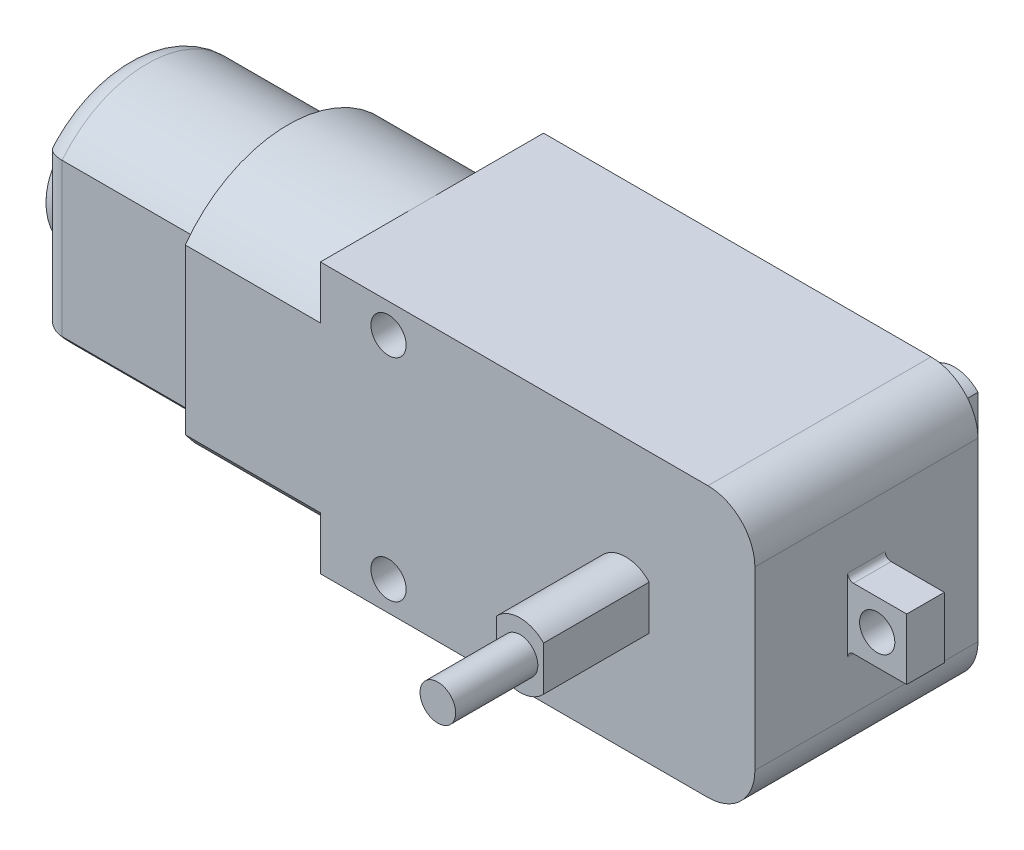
ISO-10303-21;
HEADER;
FILE_DESCRIPTION(('STEP AP214'),'2;1');
FILE_NAME('part.step','',(''),(''),'','','');
FILE_SCHEMA(('AUTOMOTIVE_DESIGN { 1 0 10303 214 1 1 1 1 }'));
ENDSEC;
DATA;
#1=APPLICATION_CONTEXT('core data for automotive mechanical design processes');
#2=APPLICATION_PROTOCOL_DEFINITION('international standard','automotive_design',2000,#1);
#3=PRODUCT_CONTEXT('',#1,'mechanical');
#4=PRODUCT('Part','Part','',(#3));
#5=PRODUCT_RELATED_PRODUCT_CATEGORY('part','',(#4));
#6=PRODUCT_DEFINITION_FORMATION('','',#4);
#7=PRODUCT_DEFINITION_CONTEXT('part definition',#1,'design');
#8=PRODUCT_DEFINITION('design','',#6,#7);
#9=PRODUCT_DEFINITION_SHAPE('','',#8);
#10=(LENGTH_UNIT() NAMED_UNIT(*) SI_UNIT(.MILLI.,.METRE.));
#11=(NAMED_UNIT(*) PLANE_ANGLE_UNIT() SI_UNIT($,.RADIAN.));
#12=(NAMED_UNIT(*) SI_UNIT($,.STERADIAN.) SOLID_ANGLE_UNIT());
#13=UNCERTAINTY_MEASURE_WITH_UNIT(LENGTH_MEASURE(1.E-05),#10,'distance_accuracy_value','');
#14=(GEOMETRIC_REPRESENTATION_CONTEXT(3) GLOBAL_UNCERTAINTY_ASSIGNED_CONTEXT((#13)) GLOBAL_UNIT_ASSIGNED_CONTEXT((#10,
#11,#12)) REPRESENTATION_CONTEXT('',''));
#15=CARTESIAN_POINT('',(0.,0.,0.));
#16=DIRECTION('',(0.,0.,1.));
#17=DIRECTION('',(1.,0.,0.));
#18=AXIS2_PLACEMENT_3D('',#15,#16,#17);
#19=CARTESIAN_POINT('',(26.,0.,18.5));
#20=DIRECTION('',(0.,0.,-1.));
#21=DIRECTION('',(-1.,0.,0.));
#22=AXIS2_PLACEMENT_3D('',#19,#20,#21);
#23=PLANE('',#22);
#24=DIRECTION('',(0.,1.,0.));
#25=VECTOR('',#24,1.);
#26=CARTESIAN_POINT('',(24.,-1.88745860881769,18.5));
#27=LINE('',#26,#25);
#28=CARTESIAN_POINT('',(24.,-1.88745860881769,18.5));
#29=VERTEX_POINT('',#28);
#30=CARTESIAN_POINT('',(24.,1.88745860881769,18.5));
#31=VERTEX_POINT('',#30);
#32=EDGE_CURVE('E683',#29,#31,#27,.T.);
#33=ORIENTED_EDGE('',*,*,#32,.F.);
#34=CARTESIAN_POINT('',(26.,0.,18.5));
#35=DIRECTION('',(0.,0.,-1.));
#36=DIRECTION('',(-1.,0.,0.));
#37=AXIS2_PLACEMENT_3D('',#34,#35,#36);
#38=CIRCLE('',#37,2.75);
#39=CARTESIAN_POINT('',(28.,-1.88745860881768,18.5));
#40=VERTEX_POINT('',#39);
#41=EDGE_CURVE('E691',#40,#29,#38,.T.);
#42=ORIENTED_EDGE('',*,*,#41,.F.);
#43=DIRECTION('',(0.,1.,0.));
#44=VECTOR('',#43,1.);
#45=CARTESIAN_POINT('',(28.,-1.88745860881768,18.5));
#46=LINE('',#45,#44);
#47=CARTESIAN_POINT('',(28.,1.88745860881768,18.5));
#48=VERTEX_POINT('',#47);
#49=EDGE_CURVE('E689',#40,#48,#46,.T.);
#50=ORIENTED_EDGE('',*,*,#49,.T.);
#51=CARTESIAN_POINT('',(26.,0.,18.5));
#52=DIRECTION('',(0.,0.,-1.));
#53=DIRECTION('',(-1.,0.,0.));
#54=AXIS2_PLACEMENT_3D('',#51,#52,#53);
#55=CIRCLE('',#54,2.75);
#56=EDGE_CURVE('E686',#31,#48,#55,.T.);
#57=ORIENTED_EDGE('',*,*,#56,.F.);
#58=EDGE_LOOP('',(#33,#42,#50,#57));
#59=FACE_BOUND('',#58,.T.);
#60=CARTESIAN_POINT('',(26.,0.,18.5));
#61=DIRECTION('',(0.,0.,-1.));
#62=DIRECTION('',(-1.,0.,0.));
#63=AXIS2_PLACEMENT_3D('',#60,#61,#62);
#64=CIRCLE('',#63,1.51682352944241);
#65=CARTESIAN_POINT('',(24.4831764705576,0.,18.5));
#66=VERTEX_POINT('',#65);
#67=EDGE_CURVE('E11',#66,#66,#64,.F.);
#68=ORIENTED_EDGE('',*,*,#67,.F.);
#69=EDGE_LOOP('',(#68));
#70=FACE_BOUND('',#69,.T.);
#71=ADVANCED_FACE('F33',(#59,#70),#23,.F.);
#72=CARTESIAN_POINT('',(-25.5,0.743055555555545,0.749999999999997));
#73=DIRECTION('',(-1.,0.,0.));
#74=DIRECTION('',(0.,0.,1.));
#75=AXIS2_PLACEMENT_3D('',#72,#73,#74);
#76=PLANE('',#75);
#77=CARTESIAN_POINT('',(-25.5,-0.743055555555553,0.75));
#78=DIRECTION('',(-1.,0.,0.));
#79=DIRECTION('',(0.,0.,1.));
#80=AXIS2_PLACEMENT_3D('',#77,#78,#79);
#81=CIRCLE('',#80,7.25694444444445);
#82=CARTESIAN_POINT('',(-25.5,-5.75311969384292,-4.5));
#83=VERTEX_POINT('',#82);
#84=CARTESIAN_POINT('',(-25.5,-5.75311969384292,6.));
#85=VERTEX_POINT('',#84);
#86=EDGE_CURVE('E315',#83,#85,#81,.T.);
#87=ORIENTED_EDGE('',*,*,#86,.T.);
#88=DIRECTION('',(0.,1.,0.));
#89=VECTOR('',#88,1.);
#90=CARTESIAN_POINT('',(-25.5,6.49879360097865,6.));
#91=LINE('',#90,#89);
#92=CARTESIAN_POINT('',(-25.5,5.75311969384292,6.));
#93=VERTEX_POINT('',#92);
#94=EDGE_CURVE('E317',#85,#93,#91,.T.);
#95=ORIENTED_EDGE('',*,*,#94,.T.);
#96=CARTESIAN_POINT('',(-25.5,0.743055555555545,0.749999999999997));
#97=DIRECTION('',(-1.,0.,0.));
#98=DIRECTION('',(0.,0.,1.));
#99=AXIS2_PLACEMENT_3D('',#96,#97,#98);
#100=CIRCLE('',#99,7.25694444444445);
#101=CARTESIAN_POINT('',(-25.5,5.75311969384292,-4.5));
#102=VERTEX_POINT('',#101);
#103=EDGE_CURVE('E300',#93,#102,#100,.T.);
#104=ORIENTED_EDGE('',*,*,#103,.T.);
#105=DIRECTION('',(0.,-1.,0.));
#106=VECTOR('',#105,1.);
#107=CARTESIAN_POINT('',(-25.5,-6.49879360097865,-4.5));
#108=LINE('',#107,#106);
#109=EDGE_CURVE('E313',#102,#83,#108,.T.);
#110=ORIENTED_EDGE('',*,*,#109,.T.);
#111=EDGE_LOOP('',(#87,#95,#104,#110));
#112=FACE_BOUND('',#111,.T.);
#113=CARTESIAN_POINT('',(-25.5,0.,0.749999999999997));
#114=DIRECTION('',(-1.,0.,0.));
#115=DIRECTION('',(0.,0.,1.));
#116=AXIS2_PLACEMENT_3D('',#113,#114,#115);
#117=CIRCLE('',#116,5.);
#118=CARTESIAN_POINT('',(-25.5,0.,5.75));
#119=VERTEX_POINT('',#118);
#120=EDGE_CURVE('E336',#119,#119,#117,.T.);
#121=ORIENTED_EDGE('',*,*,#120,.F.);
#122=EDGE_LOOP('',(#121));
#123=FACE_BOUND('',#122,.T.);
#124=ADVANCED_FACE('F377',(#112,#123),#76,.T.);
#125=CARTESIAN_POINT('',(-11.5,-0.743055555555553,0.75));
#126=DIRECTION('',(-1.,0.,0.));
#127=DIRECTION('',(0.,0.,1.));
#128=AXIS2_PLACEMENT_3D('',#125,#126,#127);
#129=PLANE('',#128);
#130=DIRECTION('',(0.,-1.,0.));
#131=VECTOR('',#130,1.);
#132=CARTESIAN_POINT('',(-11.5,7.,-8.));
#133=LINE('',#132,#131);
#134=CARTESIAN_POINT('',(-11.5,7.,-8.));
#135=VERTEX_POINT('',#134);
#136=CARTESIAN_POINT('',(-11.5,-7.,-8.));
#137=VERTEX_POINT('',#136);
#138=EDGE_CURVE('E269',#135,#137,#133,.T.);
#139=ORIENTED_EDGE('',*,*,#138,.T.);
#140=CARTESIAN_POINT('',(-11.5,-0.743055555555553,0.75));
#141=DIRECTION('',(-1.,0.,0.));
#142=DIRECTION('',(0.,0.,1.));
#143=AXIS2_PLACEMENT_3D('',#140,#141,#142);
#144=CIRCLE('',#143,10.7569444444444);
#145=CARTESIAN_POINT('',(-11.5,-7.,9.5));
#146=VERTEX_POINT('',#145);
#147=EDGE_CURVE('E272',#137,#146,#144,.T.);
#148=ORIENTED_EDGE('',*,*,#147,.T.);
#149=DIRECTION('',(0.,1.,0.));
#150=VECTOR('',#149,1.);
#151=CARTESIAN_POINT('',(-11.5,-7.,9.5));
#152=LINE('',#151,#150);
#153=CARTESIAN_POINT('',(-11.5,7.,9.5));
#154=VERTEX_POINT('',#153);
#155=EDGE_CURVE('E275',#146,#154,#152,.T.);
#156=ORIENTED_EDGE('',*,*,#155,.T.);
#157=CARTESIAN_POINT('',(-11.5,0.743055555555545,0.749999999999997));
#158=DIRECTION('',(1.,0.,0.));
#159=DIRECTION('',(0.,0.,-1.));
#160=AXIS2_PLACEMENT_3D('',#157,#158,#159);
#161=CIRCLE('',#160,10.7569444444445);
#162=EDGE_CURVE('E277',#135,#154,#161,.T.);
#163=ORIENTED_EDGE('',*,*,#162,.F.);
#164=EDGE_LOOP('',(#139,#148,#156,#163));
#165=FACE_BOUND('',#164,.T.);
#166=DIRECTION('',(0.,-1.,0.));
#167=VECTOR('',#166,1.);
#168=CARTESIAN_POINT('',(-11.5,6.49879360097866,-6.5));
#169=LINE('',#168,#167);
#170=CARTESIAN_POINT('',(-11.5,6.49879360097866,-6.5));
#171=VERTEX_POINT('',#170);
#172=CARTESIAN_POINT('',(-11.5,-6.49879360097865,-6.5));
#173=VERTEX_POINT('',#172);
#174=EDGE_CURVE('E239',#171,#173,#169,.T.);
#175=ORIENTED_EDGE('',*,*,#174,.F.);
#176=CARTESIAN_POINT('',(-11.5,0.743055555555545,0.749999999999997));
#177=DIRECTION('',(-1.,0.,0.));
#178=DIRECTION('',(0.,0.,1.));
#179=AXIS2_PLACEMENT_3D('',#176,#177,#178);
#180=CIRCLE('',#179,9.25694444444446);
#181=CARTESIAN_POINT('',(-11.5,6.49879360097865,8.));
#182=VERTEX_POINT('',#181);
#183=EDGE_CURVE('E247',#182,#171,#180,.T.);
#184=ORIENTED_EDGE('',*,*,#183,.F.);
#185=DIRECTION('',(0.,1.,0.));
#186=VECTOR('',#185,1.);
#187=CARTESIAN_POINT('',(-11.5,-6.49879360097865,8.));
#188=LINE('',#187,#186);
#189=CARTESIAN_POINT('',(-11.5,-6.49879360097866,8.));
#190=VERTEX_POINT('',#189);
#191=EDGE_CURVE('E260',#190,#182,#188,.T.);
#192=ORIENTED_EDGE('',*,*,#191,.F.);
#193=CARTESIAN_POINT('',(-11.5,-0.743055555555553,0.75));
#194=DIRECTION('',(-1.,0.,0.));
#195=DIRECTION('',(0.,0.,1.));
#196=AXIS2_PLACEMENT_3D('',#193,#194,#195);
#197=CIRCLE('',#196,9.25694444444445);
#198=EDGE_CURVE('E258',#173,#190,#197,.T.);
#199=ORIENTED_EDGE('',*,*,#198,.F.);
#200=EDGE_LOOP('',(#175,#184,#192,#199));
#201=FACE_BOUND('',#200,.T.);
#202=ADVANCED_FACE('F256',(#165,#201),#129,.T.);
#203=CARTESIAN_POINT('',(0.,0.,0.));
#204=DIRECTION('',(-1.,0.,0.));
#205=DIRECTION('',(0.,0.,1.));
#206=AXIS2_PLACEMENT_3D('',#203,#204,#205);
#207=PLANE('',#206);
#208=DIRECTION('',(0.,0.,1.));
#209=VECTOR('',#208,1.);
#210=CARTESIAN_POINT('',(0.,11.5,9.5));
#211=LINE('',#210,#209);
#212=CARTESIAN_POINT('',(0.,11.5,0.749999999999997));
#213=VERTEX_POINT('',#212);
#214=CARTESIAN_POINT('',(0.,11.5,9.5));
#215=VERTEX_POINT('',#214);
#216=EDGE_CURVE('E600',#213,#215,#211,.T.);
#217=ORIENTED_EDGE('',*,*,#216,.F.);
#218=CARTESIAN_POINT('',(0.,0.743055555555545,0.749999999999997));
#219=DIRECTION('',(1.,0.,0.));
#220=DIRECTION('',(0.,0.,-1.));
#221=AXIS2_PLACEMENT_3D('',#218,#219,#220);
#222=CIRCLE('',#221,10.7569444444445);
#223=CARTESIAN_POINT('',(0.,7.,9.5));
#224=VERTEX_POINT('',#223);
#225=EDGE_CURVE('E294',#213,#224,#222,.T.);
#226=ORIENTED_EDGE('',*,*,#225,.T.);
#227=DIRECTION('',(0.,-1.,0.));
#228=VECTOR('',#227,1.);
#229=CARTESIAN_POINT('',(0.,-11.5,9.5));
#230=LINE('',#229,#228);
#231=EDGE_CURVE('E512',#215,#224,#230,.T.);
#232=ORIENTED_EDGE('',*,*,#231,.F.);
#233=EDGE_LOOP('',(#217,#226,#232));
#234=FACE_BOUND('',#233,.T.);
#235=ADVANCED_FACE('F452',(#234),#207,.T.);
#236=DIRECTION('',(0.,-1.,0.));
#237=VECTOR('',#236,1.);
#238=CARTESIAN_POINT('',(0.,7.,-8.));
#239=LINE('',#238,#237);
#240=CARTESIAN_POINT('',(0.,7.,-8.));
#241=VERTEX_POINT('',#240);
#242=CARTESIAN_POINT('',(0.,-7.,-8.));
#243=VERTEX_POINT('',#242);
#244=EDGE_CURVE('E243',#241,#243,#239,.T.);
#245=ORIENTED_EDGE('',*,*,#244,.F.);
#246=EDGE_CURVE('E273',#241,#213,#222,.T.);
#247=ORIENTED_EDGE('',*,*,#246,.T.);
#248=CARTESIAN_POINT('',(0.,11.5,-9.5));
#249=VERTEX_POINT('',#248);
#250=EDGE_CURVE('E518',#249,#213,#211,.T.);
#251=ORIENTED_EDGE('',*,*,#250,.F.);
#252=DIRECTION('',(0.,1.,0.));
#253=VECTOR('',#252,1.);
#254=CARTESIAN_POINT('',(0.,-11.5,-9.5));
#255=LINE('',#254,#253);
#256=CARTESIAN_POINT('',(0.,-11.5,-9.5));
#257=VERTEX_POINT('',#256);
#258=EDGE_CURVE('E595',#257,#249,#255,.T.);
#259=ORIENTED_EDGE('',*,*,#258,.F.);
#260=DIRECTION('',(0.,0.,-1.));
#261=VECTOR('',#260,1.);
#262=CARTESIAN_POINT('',(0.,-11.5,9.5));
#263=LINE('',#262,#261);
#264=CARTESIAN_POINT('',(0.,-11.5,0.75));
#265=VERTEX_POINT('',#264);
#266=EDGE_CURVE('E514',#265,#257,#263,.T.);
#267=ORIENTED_EDGE('',*,*,#266,.F.);
#268=CARTESIAN_POINT('',(0.,-0.743055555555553,0.75));
#269=DIRECTION('',(-1.,0.,0.));
#270=DIRECTION('',(0.,0.,1.));
#271=AXIS2_PLACEMENT_3D('',#268,#269,#270);
#272=CIRCLE('',#271,10.7569444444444);
#273=EDGE_CURVE('E283',#243,#265,#272,.T.);
#274=ORIENTED_EDGE('',*,*,#273,.F.);
#275=EDGE_LOOP('',(#245,#247,#251,#259,#267,#274));
#276=FACE_BOUND('',#275,.T.);
#277=ADVANCED_FACE('F453',(#276),#207,.T.);
#278=CARTESIAN_POINT('',(37.,-11.5,-9.5));
#279=DIRECTION('',(0.,0.,1.));
#280=DIRECTION('',(1.,0.,0.));
#281=AXIS2_PLACEMENT_3D('',#278,#279,#280);
#282=PLANE('',#281);
#283=CARTESIAN_POINT('',(5.8,-9.,-9.5));
#284=DIRECTION('',(0.,0.,-1.));
#285=DIRECTION('',(-1.,0.,0.));
#286=AXIS2_PLACEMENT_3D('',#283,#284,#285);
#287=CIRCLE('',#286,1.5);
#288=CARTESIAN_POINT('',(4.3,-9.,-9.5));
#289=VERTEX_POINT('',#288);
#290=EDGE_CURVE('E1012',#289,#289,#287,.T.);
#291=ORIENTED_EDGE('',*,*,#290,.F.);
#292=EDGE_LOOP('',(#291));
#293=FACE_BOUND('',#292,.T.);
#294=CARTESIAN_POINT('',(5.8,9.00000000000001,-9.5));
#295=DIRECTION('',(0.,0.,-1.));
#296=DIRECTION('',(-1.,0.,0.));
#297=AXIS2_PLACEMENT_3D('',#294,#295,#296);
#298=CIRCLE('',#297,1.5);
#299=CARTESIAN_POINT('',(4.3,9.00000000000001,-9.5));
#300=VERTEX_POINT('',#299);
#301=EDGE_CURVE('E1018',#300,#300,#298,.T.);
#302=ORIENTED_EDGE('',*,*,#301,.F.);
#303=EDGE_LOOP('',(#302));
#304=FACE_BOUND('',#303,.T.);
#305=DIRECTION('',(0.,1.,0.));
#306=VECTOR('',#305,1.);
#307=CARTESIAN_POINT('',(37.,-11.5,-9.5));
#308=LINE('',#307,#306);
#309=CARTESIAN_POINT('',(37.,-7.5,-9.5));
#310=VERTEX_POINT('',#309);
#311=CARTESIAN_POINT('',(37.,7.5,-9.5));
#312=VERTEX_POINT('',#311);
#313=EDGE_CURVE('E524',#310,#312,#308,.T.);
#314=ORIENTED_EDGE('',*,*,#313,.F.);
#315=CARTESIAN_POINT('',(33.,-7.5,-9.5));
#316=DIRECTION('',(0.,0.,1.));
#317=DIRECTION('',(1.,0.,0.));
#318=AXIS2_PLACEMENT_3D('',#315,#316,#317);
#319=CIRCLE('',#318,4.);
#320=CARTESIAN_POINT('',(33.,-11.5,-9.5));
#321=VERTEX_POINT('',#320);
#322=EDGE_CURVE('E545',#310,#321,#319,.F.);
#323=ORIENTED_EDGE('',*,*,#322,.T.);
#324=DIRECTION('',(-1.,0.,0.));
#325=VECTOR('',#324,1.);
#326=CARTESIAN_POINT('',(37.,-11.5,-9.5));
#327=LINE('',#326,#325);
#328=EDGE_CURVE('E525',#321,#257,#327,.T.);
#329=ORIENTED_EDGE('',*,*,#328,.T.);
#330=ORIENTED_EDGE('',*,*,#258,.T.);
#331=DIRECTION('',(-1.,0.,0.));
#332=VECTOR('',#331,1.);
#333=CARTESIAN_POINT('',(37.,11.5,-9.5));
#334=LINE('',#333,#332);
#335=CARTESIAN_POINT('',(33.,11.5,-9.5));
#336=VERTEX_POINT('',#335);
#337=EDGE_CURVE('E535',#336,#249,#334,.T.);
#338=ORIENTED_EDGE('',*,*,#337,.F.);
#339=CARTESIAN_POINT('',(33.,7.5,-9.5));
#340=DIRECTION('',(0.,0.,1.));
#341=DIRECTION('',(1.,0.,0.));
#342=AXIS2_PLACEMENT_3D('',#339,#340,#341);
#343=CIRCLE('',#342,4.);
#344=EDGE_CURVE('E543',#336,#312,#343,.F.);
#345=ORIENTED_EDGE('',*,*,#344,.T.);
#346=EDGE_LOOP('',(#314,#323,#329,#330,#338,#345));
#347=FACE_BOUND('',#346,.T.);
#348=CARTESIAN_POINT('',(26.,0.,-9.5));
#349=DIRECTION('',(0.,0.,1.));
#350=DIRECTION('',(1.,0.,0.));
#351=AXIS2_PLACEMENT_3D('',#348,#349,#350);
#352=CIRCLE('',#351,2.75);
#353=CARTESIAN_POINT('',(28.,1.88745860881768,-9.5));
#354=VERTEX_POINT('',#353);
#355=CARTESIAN_POINT('',(24.,1.88745860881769,-9.5));
#356=VERTEX_POINT('',#355);
#357=EDGE_CURVE('E698',#354,#356,#352,.T.);
#358=ORIENTED_EDGE('',*,*,#357,.T.);
#359=DIRECTION('',(0.,-1.,0.));
#360=VECTOR('',#359,1.);
#361=CARTESIAN_POINT('',(24.,-11.5,-9.5));
#362=LINE('',#361,#360);
#363=CARTESIAN_POINT('',(24.,-1.88745860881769,-9.5));
#364=VERTEX_POINT('',#363);
#365=EDGE_CURVE('E717',#356,#364,#362,.T.);
#366=ORIENTED_EDGE('',*,*,#365,.T.);
#367=CARTESIAN_POINT('',(26.,0.,-9.5));
#368=DIRECTION('',(0.,0.,1.));
#369=DIRECTION('',(1.,0.,0.));
#370=AXIS2_PLACEMENT_3D('',#367,#368,#369);
#371=CIRCLE('',#370,2.75);
#372=CARTESIAN_POINT('',(28.,-1.88745860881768,-9.5));
#373=VERTEX_POINT('',#372);
#374=EDGE_CURVE('E714',#364,#373,#371,.T.);
#375=ORIENTED_EDGE('',*,*,#374,.T.);
#376=DIRECTION('',(0.,-1.,0.));
#377=VECTOR('',#376,1.);
#378=CARTESIAN_POINT('',(28.,-11.5,-9.5));
#379=LINE('',#378,#377);
#380=EDGE_CURVE('E712',#354,#373,#379,.T.);
#381=ORIENTED_EDGE('',*,*,#380,.F.);
#382=EDGE_LOOP('',(#358,#366,#375,#381));
#383=FACE_BOUND('',#382,.T.);
#384=CARTESIAN_POINT('',(14.,0.,-9.5));
#385=DIRECTION('',(0.,0.,1.));
#386=DIRECTION('',(1.,0.,0.));
#387=AXIS2_PLACEMENT_3D('',#384,#385,#386);
#388=CIRCLE('',#387,2.);
#389=CARTESIAN_POINT('',(16.,0.,-9.5));
#390=VERTEX_POINT('',#389);
#391=EDGE_CURVE('E295',#390,#390,#388,.F.);
#392=ORIENTED_EDGE('',*,*,#391,.F.);
#393=EDGE_LOOP('',(#392));
#394=FACE_BOUND('',#393,.T.);
#395=ADVANCED_FACE('F444',(#293,#304,#347,#383,#394),#282,.F.);
#396=CARTESIAN_POINT('',(37.,0.,0.));
#397=DIRECTION('',(-1.,0.,0.));
#398=DIRECTION('',(0.,0.,1.));
#399=AXIS2_PLACEMENT_3D('',#396,#397,#398);
#400=PLANE('',#399);
#401=DIRECTION('',(0.,-1.,0.));
#402=VECTOR('',#401,1.);
#403=CARTESIAN_POINT('',(37.,-11.5,9.5));
#404=LINE('',#403,#402);
#405=CARTESIAN_POINT('',(37.,7.5,9.5));
#406=VERTEX_POINT('',#405);
#407=CARTESIAN_POINT('',(37.,-7.5,9.5));
#408=VERTEX_POINT('',#407);
#409=EDGE_CURVE('E529',#406,#408,#404,.T.);
#410=ORIENTED_EDGE('',*,*,#409,.T.);
#411=DIRECTION('',(0.,0.,-1.));
#412=VECTOR('',#411,1.);
#413=CARTESIAN_POINT('',(37.,-7.5,0.));
#414=LINE('',#413,#412);
#415=EDGE_CURVE('E540',#408,#310,#414,.T.);
#416=ORIENTED_EDGE('',*,*,#415,.T.);
#417=ORIENTED_EDGE('',*,*,#313,.T.);
#418=DIRECTION('',(0.,0.,1.));
#419=VECTOR('',#418,1.);
#420=CARTESIAN_POINT('',(37.,7.5,0.));
#421=LINE('',#420,#419);
#422=EDGE_CURVE('E537',#312,#406,#421,.T.);
#423=ORIENTED_EDGE('',*,*,#422,.T.);
#424=EDGE_LOOP('',(#410,#416,#417,#423));
#425=FACE_BOUND('',#424,.T.);
#426=DIRECTION('',(0.,1.,0.));
#427=VECTOR('',#426,1.);
#428=CARTESIAN_POINT('',(37.,-2.6,-1.6));
#429=LINE('',#428,#427);
#430=CARTESIAN_POINT('',(37.,-3.1,-1.6));
#431=VERTEX_POINT('',#430);
#432=CARTESIAN_POINT('',(37.,3.1,-1.6));
#433=VERTEX_POINT('',#432);
#434=EDGE_CURVE('E559',#431,#433,#429,.T.);
#435=ORIENTED_EDGE('',*,*,#434,.F.);
#436=DIRECTION('',(0.,0.,-1.));
#437=VECTOR('',#436,1.);
#438=CARTESIAN_POINT('',(37.,-3.1,1.6));
#439=LINE('',#438,#437);
#440=CARTESIAN_POINT('',(37.,-3.1,1.6));
#441=VERTEX_POINT('',#440);
#442=EDGE_CURVE('E487',#431,#441,#439,.F.);
#443=ORIENTED_EDGE('',*,*,#442,.T.);
#444=DIRECTION('',(0.,-1.,0.));
#445=VECTOR('',#444,1.);
#446=CARTESIAN_POINT('',(37.,-2.6,1.6));
#447=LINE('',#446,#445);
#448=CARTESIAN_POINT('',(37.,3.1,1.6));
#449=VERTEX_POINT('',#448);
#450=EDGE_CURVE('E572',#449,#441,#447,.T.);
#451=ORIENTED_EDGE('',*,*,#450,.F.);
#452=DIRECTION('',(0.,0.,1.));
#453=VECTOR('',#452,1.);
#454=CARTESIAN_POINT('',(37.,3.1,-1.6));
#455=LINE('',#454,#453);
#456=EDGE_CURVE('E563',#449,#433,#455,.F.);
#457=ORIENTED_EDGE('',*,*,#456,.T.);
#458=EDGE_LOOP('',(#435,#443,#451,#457));
#459=FACE_BOUND('',#458,.T.);
#460=ADVANCED_FACE('F440',(#425,#459),#400,.F.);
#461=CARTESIAN_POINT('',(37.,11.5,9.5));
#462=DIRECTION('',(0.,-1.,0.));
#463=DIRECTION('',(0.,0.,-1.));
#464=AXIS2_PLACEMENT_3D('',#461,#462,#463);
#465=PLANE('',#464);
#466=DIRECTION('',(-1.,0.,0.));
#467=VECTOR('',#466,1.);
#468=CARTESIAN_POINT('',(37.,11.5,9.5));
#469=LINE('',#468,#467);
#470=CARTESIAN_POINT('',(33.,11.5,9.5));
#471=VERTEX_POINT('',#470);
#472=EDGE_CURVE('E532',#471,#215,#469,.T.);
#473=ORIENTED_EDGE('',*,*,#472,.F.);
#474=DIRECTION('',(0.,0.,1.));
#475=VECTOR('',#474,1.);
#476=CARTESIAN_POINT('',(33.,11.5,9.5));
#477=LINE('',#476,#475);
#478=EDGE_CURVE('E553',#471,#336,#477,.F.);
#479=ORIENTED_EDGE('',*,*,#478,.T.);
#480=ORIENTED_EDGE('',*,*,#337,.T.);
#481=ORIENTED_EDGE('',*,*,#250,.T.);
#482=ORIENTED_EDGE('',*,*,#216,.T.);
#483=EDGE_LOOP('',(#473,#479,#480,#481,#482));
#484=FACE_BOUND('',#483,.T.);
#485=ADVANCED_FACE('F443',(#484),#465,.F.);
#486=CARTESIAN_POINT('',(37.,-11.5,9.5));
#487=DIRECTION('',(0.,0.,-1.));
#488=DIRECTION('',(-1.,0.,0.));
#489=AXIS2_PLACEMENT_3D('',#486,#487,#488);
#490=PLANE('',#489);
#491=CARTESIAN_POINT('',(5.8,-9.,9.5));
#492=DIRECTION('',(0.,0.,-1.));
#493=DIRECTION('',(-1.,0.,0.));
#494=AXIS2_PLACEMENT_3D('',#491,#492,#493);
#495=CIRCLE('',#494,1.5);
#496=CARTESIAN_POINT('',(4.3,-9.,9.5));
#497=VERTEX_POINT('',#496);
#498=EDGE_CURVE('E1015',#497,#497,#495,.T.);
#499=ORIENTED_EDGE('',*,*,#498,.T.);
#500=EDGE_LOOP('',(#499));
#501=FACE_BOUND('',#500,.T.);
#502=CARTESIAN_POINT('',(5.8,9.00000000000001,9.5));
#503=DIRECTION('',(0.,0.,-1.));
#504=DIRECTION('',(-1.,0.,0.));
#505=AXIS2_PLACEMENT_3D('',#502,#503,#504);
#506=CIRCLE('',#505,1.5);
#507=CARTESIAN_POINT('',(4.3,9.00000000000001,9.5));
#508=VERTEX_POINT('',#507);
#509=EDGE_CURVE('E1021',#508,#508,#506,.T.);
#510=ORIENTED_EDGE('',*,*,#509,.T.);
#511=EDGE_LOOP('',(#510));
#512=FACE_BOUND('',#511,.T.);
#513=CARTESIAN_POINT('',(26.,0.,9.5));
#514=DIRECTION('',(0.,0.,-1.));
#515=DIRECTION('',(-1.,0.,0.));
#516=AXIS2_PLACEMENT_3D('',#513,#514,#515);
#517=CIRCLE('',#516,2.75);
#518=CARTESIAN_POINT('',(28.,-1.88745860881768,9.5));
#519=VERTEX_POINT('',#518);
#520=CARTESIAN_POINT('',(24.,-1.88745860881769,9.5));
#521=VERTEX_POINT('',#520);
#522=EDGE_CURVE('E505',#519,#521,#517,.T.);
#523=ORIENTED_EDGE('',*,*,#522,.T.);
#524=DIRECTION('',(0.,1.,0.));
#525=VECTOR('',#524,1.);
#526=CARTESIAN_POINT('',(24.,-11.5,9.5));
#527=LINE('',#526,#525);
#528=CARTESIAN_POINT('',(24.,1.88745860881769,9.5));
#529=VERTEX_POINT('',#528);
#530=EDGE_CURVE('E508',#521,#529,#527,.T.);
#531=ORIENTED_EDGE('',*,*,#530,.T.);
#532=CARTESIAN_POINT('',(26.,0.,9.5));
#533=DIRECTION('',(0.,0.,-1.));
#534=DIRECTION('',(-1.,0.,0.));
#535=AXIS2_PLACEMENT_3D('',#532,#533,#534);
#536=CIRCLE('',#535,2.75);
#537=CARTESIAN_POINT('',(28.,1.88745860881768,9.5));
#538=VERTEX_POINT('',#537);
#539=EDGE_CURVE('E493',#529,#538,#536,.T.);
#540=ORIENTED_EDGE('',*,*,#539,.T.);
#541=DIRECTION('',(0.,1.,0.));
#542=VECTOR('',#541,1.);
#543=CARTESIAN_POINT('',(28.,-11.5,9.5));
#544=LINE('',#543,#542);
#545=EDGE_CURVE('E497',#519,#538,#544,.T.);
#546=ORIENTED_EDGE('',*,*,#545,.F.);
#547=EDGE_LOOP('',(#523,#531,#540,#546));
#548=FACE_BOUND('',#547,.T.);
#549=DIRECTION('',(-1.,0.,0.));
#550=VECTOR('',#549,1.);
#551=CARTESIAN_POINT('',(37.,-11.5,9.5));
#552=LINE('',#551,#550);
#553=CARTESIAN_POINT('',(33.,-11.5,9.5));
#554=VERTEX_POINT('',#553);
#555=CARTESIAN_POINT('',(0.,-11.5,9.5));
#556=VERTEX_POINT('',#555);
#557=EDGE_CURVE('E528',#554,#556,#552,.T.);
#558=ORIENTED_EDGE('',*,*,#557,.F.);
#559=CARTESIAN_POINT('',(33.,-7.5,9.5));
#560=DIRECTION('',(0.,0.,-1.));
#561=DIRECTION('',(-1.,0.,0.));
#562=AXIS2_PLACEMENT_3D('',#559,#560,#561);
#563=CIRCLE('',#562,4.);
#564=EDGE_CURVE('E551',#554,#408,#563,.F.);
#565=ORIENTED_EDGE('',*,*,#564,.T.);
#566=ORIENTED_EDGE('',*,*,#409,.F.);
#567=CARTESIAN_POINT('',(33.,7.5,9.5));
#568=DIRECTION('',(0.,0.,-1.));
#569=DIRECTION('',(-1.,0.,0.));
#570=AXIS2_PLACEMENT_3D('',#567,#568,#569);
#571=CIRCLE('',#570,4.);
#572=EDGE_CURVE('E549',#406,#471,#571,.F.);
#573=ORIENTED_EDGE('',*,*,#572,.T.);
#574=ORIENTED_EDGE('',*,*,#472,.T.);
#575=ORIENTED_EDGE('',*,*,#231,.T.);
#576=DIRECTION('',(1.,0.,0.));
#577=VECTOR('',#576,1.);
#578=CARTESIAN_POINT('',(-11.5,7.,9.5));
#579=LINE('',#578,#577);
#580=EDGE_CURVE('E305',#154,#224,#579,.T.);
#581=ORIENTED_EDGE('',*,*,#580,.F.);
#582=ORIENTED_EDGE('',*,*,#155,.F.);
#583=DIRECTION('',(1.,0.,0.));
#584=VECTOR('',#583,1.);
#585=CARTESIAN_POINT('',(-11.5,-7.,9.5));
#586=LINE('',#585,#584);
#587=CARTESIAN_POINT('',(0.,-7.,9.5));
#588=VERTEX_POINT('',#587);
#589=EDGE_CURVE('E301',#146,#588,#586,.T.);
#590=ORIENTED_EDGE('',*,*,#589,.T.);
#591=EDGE_CURVE('E296',#588,#556,#230,.T.);
#592=ORIENTED_EDGE('',*,*,#591,.T.);
#593=EDGE_LOOP('',(#558,#565,#566,#573,#574,#575,#581,#582,#590,#592));
#594=FACE_BOUND('',#593,.T.);
#595=ADVANCED_FACE('F456',(#501,#512,#548,#594),#490,.F.);
#596=CARTESIAN_POINT('',(37.,-11.5,9.5));
#597=DIRECTION('',(0.,1.,0.));
#598=DIRECTION('',(0.,0.,1.));
#599=AXIS2_PLACEMENT_3D('',#596,#597,#598);
#600=PLANE('',#599);
#601=ORIENTED_EDGE('',*,*,#328,.F.);
#602=DIRECTION('',(0.,0.,-1.));
#603=VECTOR('',#602,1.);
#604=CARTESIAN_POINT('',(33.,-11.5,9.5));
#605=LINE('',#604,#603);
#606=EDGE_CURVE('E547',#321,#554,#605,.F.);
#607=ORIENTED_EDGE('',*,*,#606,.T.);
#608=ORIENTED_EDGE('',*,*,#557,.T.);
#609=EDGE_CURVE('E520',#556,#265,#263,.T.);
#610=ORIENTED_EDGE('',*,*,#609,.T.);
#611=ORIENTED_EDGE('',*,*,#266,.T.);
#612=EDGE_LOOP('',(#601,#607,#608,#610,#611));
#613=FACE_BOUND('',#612,.T.);
#614=ADVANCED_FACE('F450',(#613),#600,.F.);
#615=EDGE_CURVE('E290',#265,#588,#272,.T.);
#616=ORIENTED_EDGE('',*,*,#615,.F.);
#617=ORIENTED_EDGE('',*,*,#609,.F.);
#618=ORIENTED_EDGE('',*,*,#591,.F.);
#619=EDGE_LOOP('',(#616,#617,#618));
#620=FACE_BOUND('',#619,.T.);
#621=ADVANCED_FACE('F446',(#620),#207,.T.);
#622=CARTESIAN_POINT('',(33.,-7.5,0.));
#623=DIRECTION('',(0.,0.,-1.));
#624=DIRECTION('',(-1.,0.,0.));
#625=AXIS2_PLACEMENT_3D('',#622,#623,#624);
#626=CYLINDRICAL_SURFACE('',#625,4.);
#627=ORIENTED_EDGE('',*,*,#564,.F.);
#628=ORIENTED_EDGE('',*,*,#606,.F.);
#629=ORIENTED_EDGE('',*,*,#322,.F.);
#630=ORIENTED_EDGE('',*,*,#415,.F.);
#631=EDGE_LOOP('',(#627,#628,#629,#630));
#632=FACE_BOUND('',#631,.T.);
#633=ADVANCED_FACE('F449',(#632),#626,.T.);
#634=CARTESIAN_POINT('',(33.,7.5,0.));
#635=DIRECTION('',(0.,0.,1.));
#636=DIRECTION('',(1.,0.,0.));
#637=AXIS2_PLACEMENT_3D('',#634,#635,#636);
#638=CYLINDRICAL_SURFACE('',#637,4.);
#639=ORIENTED_EDGE('',*,*,#344,.F.);
#640=ORIENTED_EDGE('',*,*,#478,.F.);
#641=ORIENTED_EDGE('',*,*,#572,.F.);
#642=ORIENTED_EDGE('',*,*,#422,.F.);
#643=EDGE_LOOP('',(#639,#640,#641,#642));
#644=FACE_BOUND('',#643,.T.);
#645=ADVANCED_FACE('F438',(#644),#638,.T.);
#646=CARTESIAN_POINT('',(42.0308145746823,-2.6,-1.6));
#647=DIRECTION('',(0.,0.,1.));
#648=DIRECTION('',(1.,0.,0.));
#649=AXIS2_PLACEMENT_3D('',#646,#647,#648);
#650=PLANE('',#649);
#651=CARTESIAN_POINT('',(39.5154072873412,0.,-1.6));
#652=DIRECTION('',(0.,0.,-1.));
#653=DIRECTION('',(-1.,0.,0.));
#654=AXIS2_PLACEMENT_3D('',#651,#652,#653);
#655=CIRCLE('',#654,1.5);
#656=CARTESIAN_POINT('',(38.0154072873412,0.,-1.6));
#657=VERTEX_POINT('',#656);
#658=EDGE_CURVE('E560',#657,#657,#655,.T.);
#659=ORIENTED_EDGE('',*,*,#658,.F.);
#660=EDGE_LOOP('',(#659));
#661=FACE_BOUND('',#660,.T.);
#662=ORIENTED_EDGE('',*,*,#434,.T.);
#663=CARTESIAN_POINT('',(37.5,3.1,-1.6));
#664=DIRECTION('',(0.,0.,1.));
#665=DIRECTION('',(1.,0.,0.));
#666=AXIS2_PLACEMENT_3D('',#663,#664,#665);
#667=CIRCLE('',#666,0.5);
#668=CARTESIAN_POINT('',(37.5,2.6,-1.6));
#669=VERTEX_POINT('',#668);
#670=EDGE_CURVE('E569',#433,#669,#667,.T.);
#671=ORIENTED_EDGE('',*,*,#670,.T.);
#672=DIRECTION('',(-1.,0.,0.));
#673=VECTOR('',#672,1.);
#674=CARTESIAN_POINT('',(42.0308145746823,2.6,-1.6));
#675=LINE('',#674,#673);
#676=CARTESIAN_POINT('',(42.0308145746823,2.6,-1.6));
#677=VERTEX_POINT('',#676);
#678=EDGE_CURVE('E588',#677,#669,#675,.T.);
#679=ORIENTED_EDGE('',*,*,#678,.F.);
#680=DIRECTION('',(0.,1.,0.));
#681=VECTOR('',#680,1.);
#682=CARTESIAN_POINT('',(42.0308145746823,-2.6,-1.6));
#683=LINE('',#682,#681);
#684=CARTESIAN_POINT('',(42.0308145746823,-2.6,-1.6));
#685=VERTEX_POINT('',#684);
#686=EDGE_CURVE('E722',#685,#677,#683,.T.);
#687=ORIENTED_EDGE('',*,*,#686,.F.);
#688=DIRECTION('',(-1.,0.,0.));
#689=VECTOR('',#688,1.);
#690=CARTESIAN_POINT('',(42.0308145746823,-2.6,-1.6));
#691=LINE('',#690,#689);
#692=CARTESIAN_POINT('',(37.5,-2.6,-1.6));
#693=VERTEX_POINT('',#692);
#694=EDGE_CURVE('E580',#685,#693,#691,.T.);
#695=ORIENTED_EDGE('',*,*,#694,.T.);
#696=CARTESIAN_POINT('',(37.5,-3.1,-1.6));
#697=DIRECTION('',(0.,0.,1.));
#698=DIRECTION('',(1.,0.,0.));
#699=AXIS2_PLACEMENT_3D('',#696,#697,#698);
#700=CIRCLE('',#699,0.5);
#701=EDGE_CURVE('E494',#693,#431,#700,.T.);
#702=ORIENTED_EDGE('',*,*,#701,.T.);
#703=EDGE_LOOP('',(#662,#671,#679,#687,#695,#702));
#704=FACE_BOUND('',#703,.T.);
#705=ADVANCED_FACE('F434',(#661,#704),#650,.F.);
#706=CARTESIAN_POINT('',(42.0308145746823,2.6,1.6));
#707=DIRECTION('',(0.,-1.,0.));
#708=DIRECTION('',(0.,0.,-1.));
#709=AXIS2_PLACEMENT_3D('',#706,#707,#708);
#710=PLANE('',#709);
#711=ORIENTED_EDGE('',*,*,#678,.T.);
#712=DIRECTION('',(0.,0.,1.));
#713=VECTOR('',#712,1.);
#714=CARTESIAN_POINT('',(37.5,2.6,1.6));
#715=LINE('',#714,#713);
#716=CARTESIAN_POINT('',(37.5,2.6,1.6));
#717=VERTEX_POINT('',#716);
#718=EDGE_CURVE('E555',#669,#717,#715,.T.);
#719=ORIENTED_EDGE('',*,*,#718,.T.);
#720=DIRECTION('',(-1.,0.,0.));
#721=VECTOR('',#720,1.);
#722=CARTESIAN_POINT('',(42.0308145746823,2.6,1.6));
#723=LINE('',#722,#721);
#724=CARTESIAN_POINT('',(42.0308145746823,2.6,1.6));
#725=VERTEX_POINT('',#724);
#726=EDGE_CURVE('E585',#725,#717,#723,.T.);
#727=ORIENTED_EDGE('',*,*,#726,.F.);
#728=DIRECTION('',(0.,0.,1.));
#729=VECTOR('',#728,1.);
#730=CARTESIAN_POINT('',(42.0308145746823,2.6,1.6));
#731=LINE('',#730,#729);
#732=EDGE_CURVE('E725',#677,#725,#731,.T.);
#733=ORIENTED_EDGE('',*,*,#732,.F.);
#734=EDGE_LOOP('',(#711,#719,#727,#733));
#735=FACE_BOUND('',#734,.T.);
#736=ADVANCED_FACE('F430',(#735),#710,.F.);
#737=CARTESIAN_POINT('',(42.0308145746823,-2.6,1.6));
#738=DIRECTION('',(0.,0.,-1.));
#739=DIRECTION('',(-1.,0.,0.));
#740=AXIS2_PLACEMENT_3D('',#737,#738,#739);
#741=PLANE('',#740);
#742=CARTESIAN_POINT('',(39.5154072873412,0.,1.6));
#743=DIRECTION('',(0.,0.,-1.));
#744=DIRECTION('',(-1.,0.,0.));
#745=AXIS2_PLACEMENT_3D('',#742,#743,#744);
#746=CIRCLE('',#745,1.5);
#747=CARTESIAN_POINT('',(38.0154072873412,0.,1.6));
#748=VERTEX_POINT('',#747);
#749=EDGE_CURVE('E556',#748,#748,#746,.T.);
#750=ORIENTED_EDGE('',*,*,#749,.T.);
#751=EDGE_LOOP('',(#750));
#752=FACE_BOUND('',#751,.T.);
#753=ORIENTED_EDGE('',*,*,#450,.T.);
#754=CARTESIAN_POINT('',(37.5,-3.1,1.6));
#755=DIRECTION('',(0.,0.,-1.));
#756=DIRECTION('',(-1.,0.,0.));
#757=AXIS2_PLACEMENT_3D('',#754,#755,#756);
#758=CIRCLE('',#757,0.5);
#759=CARTESIAN_POINT('',(37.5,-2.6,1.6));
#760=VERTEX_POINT('',#759);
#761=EDGE_CURVE('E485',#441,#760,#758,.T.);
#762=ORIENTED_EDGE('',*,*,#761,.T.);
#763=DIRECTION('',(-1.,0.,0.));
#764=VECTOR('',#763,1.);
#765=CARTESIAN_POINT('',(42.0308145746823,-2.6,1.6));
#766=LINE('',#765,#764);
#767=CARTESIAN_POINT('',(42.0308145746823,-2.6,1.6));
#768=VERTEX_POINT('',#767);
#769=EDGE_CURVE('E582',#768,#760,#766,.T.);
#770=ORIENTED_EDGE('',*,*,#769,.F.);
#771=DIRECTION('',(0.,-1.,0.));
#772=VECTOR('',#771,1.);
#773=CARTESIAN_POINT('',(42.0308145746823,-2.6,1.6));
#774=LINE('',#773,#772);
#775=EDGE_CURVE('E727',#725,#768,#774,.T.);
#776=ORIENTED_EDGE('',*,*,#775,.F.);
#777=ORIENTED_EDGE('',*,*,#726,.T.);
#778=CARTESIAN_POINT('',(37.5,3.1,1.6));
#779=DIRECTION('',(0.,0.,-1.));
#780=DIRECTION('',(-1.,0.,0.));
#781=AXIS2_PLACEMENT_3D('',#778,#779,#780);
#782=CIRCLE('',#781,0.5);
#783=EDGE_CURVE('E566',#717,#449,#782,.T.);
#784=ORIENTED_EDGE('',*,*,#783,.T.);
#785=EDGE_LOOP('',(#753,#762,#770,#776,#777,#784));
#786=FACE_BOUND('',#785,.T.);
#787=ADVANCED_FACE('F426',(#752,#786),#741,.F.);
#788=CARTESIAN_POINT('',(42.0308145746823,-2.6,1.6));
#789=DIRECTION('',(0.,1.,0.));
#790=DIRECTION('',(0.,0.,1.));
#791=AXIS2_PLACEMENT_3D('',#788,#789,#790);
#792=PLANE('',#791);
#793=ORIENTED_EDGE('',*,*,#769,.T.);
#794=DIRECTION('',(0.,0.,-1.));
#795=VECTOR('',#794,1.);
#796=CARTESIAN_POINT('',(37.5,-2.6,-1.6));
#797=LINE('',#796,#795);
#798=EDGE_CURVE('E489',#760,#693,#797,.T.);
#799=ORIENTED_EDGE('',*,*,#798,.T.);
#800=ORIENTED_EDGE('',*,*,#694,.F.);
#801=DIRECTION('',(0.,0.,-1.));
#802=VECTOR('',#801,1.);
#803=CARTESIAN_POINT('',(42.0308145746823,-2.6,1.6));
#804=LINE('',#803,#802);
#805=EDGE_CURVE('E583',#768,#685,#804,.T.);
#806=ORIENTED_EDGE('',*,*,#805,.F.);
#807=EDGE_LOOP('',(#793,#799,#800,#806));
#808=FACE_BOUND('',#807,.T.);
#809=ADVANCED_FACE('F422',(#808),#792,.F.);
#810=CARTESIAN_POINT('',(42.0308145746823,0.,0.));
#811=DIRECTION('',(-1.,0.,0.));
#812=DIRECTION('',(0.,0.,1.));
#813=AXIS2_PLACEMENT_3D('',#810,#811,#812);
#814=PLANE('',#813);
#815=ORIENTED_EDGE('',*,*,#686,.T.);
#816=ORIENTED_EDGE('',*,*,#732,.T.);
#817=ORIENTED_EDGE('',*,*,#775,.T.);
#818=ORIENTED_EDGE('',*,*,#805,.T.);
#819=EDGE_LOOP('',(#815,#816,#817,#818));
#820=FACE_BOUND('',#819,.T.);
#821=ADVANCED_FACE('F418',(#820),#814,.F.);
#822=CARTESIAN_POINT('',(39.5154072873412,0.,9.5));
#823=DIRECTION('',(0.,0.,-1.));
#824=DIRECTION('',(-1.,0.,0.));
#825=AXIS2_PLACEMENT_3D('',#822,#823,#824);
#826=CYLINDRICAL_SURFACE('',#825,1.5);
#827=ORIENTED_EDGE('',*,*,#658,.T.);
#828=EDGE_LOOP('',(#827));
#829=FACE_BOUND('',#828,.T.);
#830=ORIENTED_EDGE('',*,*,#749,.F.);
#831=EDGE_LOOP('',(#830));
#832=FACE_BOUND('',#831,.T.);
#833=ADVANCED_FACE('F414',(#829,#832),#826,.F.);
#834=CARTESIAN_POINT('',(37.5,3.1,1.6));
#835=DIRECTION('',(0.,0.,-1.));
#836=DIRECTION('',(-1.,0.,0.));
#837=AXIS2_PLACEMENT_3D('',#834,#835,#836);
#838=CYLINDRICAL_SURFACE('',#837,0.5);
#839=ORIENTED_EDGE('',*,*,#670,.F.);
#840=ORIENTED_EDGE('',*,*,#456,.F.);
#841=ORIENTED_EDGE('',*,*,#783,.F.);
#842=ORIENTED_EDGE('',*,*,#718,.F.);
#843=EDGE_LOOP('',(#839,#840,#841,#842));
#844=FACE_BOUND('',#843,.T.);
#845=ADVANCED_FACE('F417',(#844),#838,.F.);
#846=CARTESIAN_POINT('',(37.5,-3.1,1.6));
#847=DIRECTION('',(0.,0.,1.));
#848=DIRECTION('',(1.,0.,0.));
#849=AXIS2_PLACEMENT_3D('',#846,#847,#848);
#850=CYLINDRICAL_SURFACE('',#849,0.5);
#851=ORIENTED_EDGE('',*,*,#761,.F.);
#852=ORIENTED_EDGE('',*,*,#442,.F.);
#853=ORIENTED_EDGE('',*,*,#701,.F.);
#854=ORIENTED_EDGE('',*,*,#798,.F.);
#855=EDGE_LOOP('',(#851,#852,#853,#854));
#856=FACE_BOUND('',#855,.T.);
#857=ADVANCED_FACE('F474',(#856),#850,.F.);
#858=CARTESIAN_POINT('',(26.,0.,18.5));
#859=DIRECTION('',(0.,0.,-1.));
#860=DIRECTION('',(-1.,0.,0.));
#861=AXIS2_PLACEMENT_3D('',#858,#859,#860);
#862=CYLINDRICAL_SURFACE('',#861,2.75);
#863=ORIENTED_EDGE('',*,*,#539,.F.);
#864=DIRECTION('',(0.,0.,-1.));
#865=VECTOR('',#864,1.);
#866=CARTESIAN_POINT('',(24.,1.88745860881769,18.5));
#867=LINE('',#866,#865);
#868=EDGE_CURVE('E707',#31,#529,#867,.T.);
#869=ORIENTED_EDGE('',*,*,#868,.F.);
#870=ORIENTED_EDGE('',*,*,#56,.T.);
#871=DIRECTION('',(0.,0.,-1.));
#872=VECTOR('',#871,1.);
#873=CARTESIAN_POINT('',(28.,1.88745860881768,18.5));
#874=LINE('',#873,#872);
#875=EDGE_CURVE('E704',#48,#538,#874,.T.);
#876=ORIENTED_EDGE('',*,*,#875,.T.);
#877=EDGE_LOOP('',(#863,#869,#870,#876));
#878=FACE_BOUND('',#877,.T.);
#879=ADVANCED_FACE('F409',(#878),#862,.T.);
#880=CARTESIAN_POINT('',(28.,-1.88745860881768,18.5));
#881=DIRECTION('',(-1.,0.,0.));
#882=DIRECTION('',(0.,0.,1.));
#883=AXIS2_PLACEMENT_3D('',#880,#881,#882);
#884=PLANE('',#883);
#885=DIRECTION('',(0.,0.,-1.));
#886=VECTOR('',#885,1.);
#887=CARTESIAN_POINT('',(28.,-1.88745860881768,18.5));
#888=LINE('',#887,#886);
#889=EDGE_CURVE('E700',#40,#519,#888,.T.);
#890=ORIENTED_EDGE('',*,*,#889,.T.);
#891=ORIENTED_EDGE('',*,*,#545,.T.);
#892=ORIENTED_EDGE('',*,*,#875,.F.);
#893=ORIENTED_EDGE('',*,*,#49,.F.);
#894=EDGE_LOOP('',(#890,#891,#892,#893));
#895=FACE_BOUND('',#894,.T.);
#896=ADVANCED_FACE('F405',(#895),#884,.F.);
#897=CARTESIAN_POINT('',(26.,0.,18.5));
#898=DIRECTION('',(0.,0.,-1.));
#899=DIRECTION('',(-1.,0.,0.));
#900=AXIS2_PLACEMENT_3D('',#897,#898,#899);
#901=CYLINDRICAL_SURFACE('',#900,2.75);
#902=ORIENTED_EDGE('',*,*,#522,.F.);
#903=ORIENTED_EDGE('',*,*,#889,.F.);
#904=ORIENTED_EDGE('',*,*,#41,.T.);
#905=DIRECTION('',(0.,0.,-1.));
#906=VECTOR('',#905,1.);
#907=CARTESIAN_POINT('',(24.,-1.88745860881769,18.5));
#908=LINE('',#907,#906);
#909=EDGE_CURVE('E695',#29,#521,#908,.T.);
#910=ORIENTED_EDGE('',*,*,#909,.T.);
#911=EDGE_LOOP('',(#902,#903,#904,#910));
#912=FACE_BOUND('',#911,.T.);
#913=ADVANCED_FACE('F400',(#912),#901,.T.);
#914=CARTESIAN_POINT('',(24.,-1.88745860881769,18.5));
#915=DIRECTION('',(-1.,0.,0.));
#916=DIRECTION('',(0.,0.,1.));
#917=AXIS2_PLACEMENT_3D('',#914,#915,#916);
#918=PLANE('',#917);
#919=ORIENTED_EDGE('',*,*,#530,.F.);
#920=ORIENTED_EDGE('',*,*,#909,.F.);
#921=ORIENTED_EDGE('',*,*,#32,.T.);
#922=ORIENTED_EDGE('',*,*,#868,.T.);
#923=EDGE_LOOP('',(#919,#920,#921,#922));
#924=FACE_BOUND('',#923,.T.);
#925=ADVANCED_FACE('F412',(#924),#918,.T.);
#926=ORIENTED_EDGE('',*,*,#365,.F.);
#927=CARTESIAN_POINT('',(24.,1.88745860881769,-18.5));
#928=VERTEX_POINT('',#927);
#929=EDGE_CURVE('E694',#356,#928,#867,.T.);
#930=ORIENTED_EDGE('',*,*,#929,.T.);
#931=DIRECTION('',(0.,1.,0.));
#932=VECTOR('',#931,1.);
#933=CARTESIAN_POINT('',(24.,-1.88745860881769,-18.5));
#934=LINE('',#933,#932);
#935=CARTESIAN_POINT('',(24.,-1.88745860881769,-18.5));
#936=VERTEX_POINT('',#935);
#937=EDGE_CURVE('E668',#936,#928,#934,.T.);
#938=ORIENTED_EDGE('',*,*,#937,.F.);
#939=EDGE_CURVE('E699',#364,#936,#908,.T.);
#940=ORIENTED_EDGE('',*,*,#939,.F.);
#941=EDGE_LOOP('',(#926,#930,#938,#940));
#942=FACE_BOUND('',#941,.T.);
#943=ADVANCED_FACE('F398',(#942),#918,.T.);
#944=ORIENTED_EDGE('',*,*,#374,.F.);
#945=ORIENTED_EDGE('',*,*,#939,.T.);
#946=CARTESIAN_POINT('',(26.,0.,-18.5));
#947=DIRECTION('',(0.,0.,-1.));
#948=DIRECTION('',(-1.,0.,0.));
#949=AXIS2_PLACEMENT_3D('',#946,#947,#948);
#950=CIRCLE('',#949,2.75);
#951=CARTESIAN_POINT('',(28.,-1.88745860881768,-18.5));
#952=VERTEX_POINT('',#951);
#953=EDGE_CURVE('E680',#952,#936,#950,.T.);
#954=ORIENTED_EDGE('',*,*,#953,.F.);
#955=EDGE_CURVE('E703',#373,#952,#888,.T.);
#956=ORIENTED_EDGE('',*,*,#955,.F.);
#957=EDGE_LOOP('',(#944,#945,#954,#956));
#958=FACE_BOUND('',#957,.T.);
#959=ADVANCED_FACE('F394',(#958),#901,.T.);
#960=CARTESIAN_POINT('',(28.,1.88745860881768,-18.5));
#961=VERTEX_POINT('',#960);
#962=EDGE_CURVE('E706',#354,#961,#874,.T.);
#963=ORIENTED_EDGE('',*,*,#962,.F.);
#964=ORIENTED_EDGE('',*,*,#380,.T.);
#965=ORIENTED_EDGE('',*,*,#955,.T.);
#966=DIRECTION('',(0.,1.,0.));
#967=VECTOR('',#966,1.);
#968=CARTESIAN_POINT('',(28.,-1.88745860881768,-18.5));
#969=LINE('',#968,#967);
#970=EDGE_CURVE('E677',#952,#961,#969,.T.);
#971=ORIENTED_EDGE('',*,*,#970,.T.);
#972=EDGE_LOOP('',(#963,#964,#965,#971));
#973=FACE_BOUND('',#972,.T.);
#974=ADVANCED_FACE('F397',(#973),#884,.F.);
#975=ORIENTED_EDGE('',*,*,#357,.F.);
#976=ORIENTED_EDGE('',*,*,#962,.T.);
#977=CARTESIAN_POINT('',(26.,0.,-18.5));
#978=DIRECTION('',(0.,0.,-1.));
#979=DIRECTION('',(-1.,0.,0.));
#980=AXIS2_PLACEMENT_3D('',#977,#978,#979);
#981=CIRCLE('',#980,2.75);
#982=EDGE_CURVE('E671',#928,#961,#981,.T.);
#983=ORIENTED_EDGE('',*,*,#982,.F.);
#984=ORIENTED_EDGE('',*,*,#929,.F.);
#985=EDGE_LOOP('',(#975,#976,#983,#984));
#986=FACE_BOUND('',#985,.T.);
#987=ADVANCED_FACE('F403',(#986),#862,.T.);
#988=CARTESIAN_POINT('',(26.,0.,-18.5));
#989=DIRECTION('',(0.,0.,-1.));
#990=DIRECTION('',(-1.,0.,0.));
#991=AXIS2_PLACEMENT_3D('',#988,#989,#990);
#992=PLANE('',#991);
#993=ORIENTED_EDGE('',*,*,#937,.T.);
#994=ORIENTED_EDGE('',*,*,#982,.T.);
#995=ORIENTED_EDGE('',*,*,#970,.F.);
#996=ORIENTED_EDGE('',*,*,#953,.T.);
#997=EDGE_LOOP('',(#993,#994,#995,#996));
#998=FACE_BOUND('',#997,.T.);
#999=ADVANCED_FACE('F392',(#998),#992,.T.);
#1000=CARTESIAN_POINT('',(14.,0.,-11.5));
#1001=DIRECTION('',(0.,0.,1.));
#1002=DIRECTION('',(1.,0.,0.));
#1003=AXIS2_PLACEMENT_3D('',#1000,#1001,#1002);
#1004=CYLINDRICAL_SURFACE('',#1003,2.);
#1005=CARTESIAN_POINT('',(14.,0.,-11.5));
#1006=DIRECTION('',(0.,0.,-1.));
#1007=DIRECTION('',(-1.,0.,0.));
#1008=AXIS2_PLACEMENT_3D('',#1005,#1006,#1007);
#1009=CIRCLE('',#1008,2.);
#1010=CARTESIAN_POINT('',(12.,0.,-11.5));
#1011=VERTEX_POINT('',#1010);
#1012=EDGE_CURVE('E665',#1011,#1011,#1009,.T.);
#1013=ORIENTED_EDGE('',*,*,#1012,.F.);
#1014=EDGE_LOOP('',(#1013));
#1015=FACE_BOUND('',#1014,.T.);
#1016=ORIENTED_EDGE('',*,*,#391,.T.);
#1017=EDGE_LOOP('',(#1016));
#1018=FACE_BOUND('',#1017,.T.);
#1019=ADVANCED_FACE('F654',(#1015,#1018),#1004,.T.);
#1020=CARTESIAN_POINT('',(14.,0.,-11.5));
#1021=DIRECTION('',(0.,0.,-1.));
#1022=DIRECTION('',(-1.,0.,0.));
#1023=AXIS2_PLACEMENT_3D('',#1020,#1021,#1022);
#1024=PLANE('',#1023);
#1025=ORIENTED_EDGE('',*,*,#1012,.T.);
#1026=EDGE_LOOP('',(#1025));
#1027=FACE_BOUND('',#1026,.T.);
#1028=ADVANCED_FACE('F648',(#1027),#1024,.T.);
#1029=CARTESIAN_POINT('',(-11.5,7.,-8.));
#1030=DIRECTION('',(0.,0.,1.));
#1031=DIRECTION('',(0.,-1.,0.));
#1032=AXIS2_PLACEMENT_3D('',#1029,#1030,#1031);
#1033=PLANE('',#1032);
#1034=ORIENTED_EDGE('',*,*,#244,.T.);
#1035=DIRECTION('',(1.,0.,0.));
#1036=VECTOR('',#1035,1.);
#1037=CARTESIAN_POINT('',(-11.5,-7.,-8.));
#1038=LINE('',#1037,#1036);
#1039=EDGE_CURVE('E304',#137,#243,#1038,.T.);
#1040=ORIENTED_EDGE('',*,*,#1039,.F.);
#1041=ORIENTED_EDGE('',*,*,#138,.F.);
#1042=DIRECTION('',(1.,0.,0.));
#1043=VECTOR('',#1042,1.);
#1044=CARTESIAN_POINT('',(-11.5,7.,-8.));
#1045=LINE('',#1044,#1043);
#1046=EDGE_CURVE('E280',#135,#241,#1045,.T.);
#1047=ORIENTED_EDGE('',*,*,#1046,.T.);
#1048=EDGE_LOOP('',(#1034,#1040,#1041,#1047));
#1049=FACE_BOUND('',#1048,.T.);
#1050=ADVANCED_FACE('F641',(#1049),#1033,.F.);
#1051=CARTESIAN_POINT('',(-11.5,-0.743055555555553,0.75));
#1052=DIRECTION('',(1.,0.,0.));
#1053=DIRECTION('',(0.,0.,-1.));
#1054=AXIS2_PLACEMENT_3D('',#1051,#1052,#1053);
#1055=CYLINDRICAL_SURFACE('',#1054,10.7569444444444);
#1056=ORIENTED_EDGE('',*,*,#273,.T.);
#1057=ORIENTED_EDGE('',*,*,#615,.T.);
#1058=ORIENTED_EDGE('',*,*,#589,.F.);
#1059=ORIENTED_EDGE('',*,*,#147,.F.);
#1060=ORIENTED_EDGE('',*,*,#1039,.T.);
#1061=EDGE_LOOP('',(#1056,#1057,#1058,#1059,#1060));
#1062=FACE_BOUND('',#1061,.T.);
#1063=ADVANCED_FACE('F639',(#1062),#1055,.T.);
#1064=CARTESIAN_POINT('',(-11.5,0.743055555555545,0.749999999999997));
#1065=DIRECTION('',(1.,0.,0.));
#1066=DIRECTION('',(0.,0.,-1.));
#1067=AXIS2_PLACEMENT_3D('',#1064,#1065,#1066);
#1068=CYLINDRICAL_SURFACE('',#1067,10.7569444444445);
#1069=ORIENTED_EDGE('',*,*,#246,.F.);
#1070=ORIENTED_EDGE('',*,*,#1046,.F.);
#1071=ORIENTED_EDGE('',*,*,#162,.T.);
#1072=ORIENTED_EDGE('',*,*,#580,.T.);
#1073=ORIENTED_EDGE('',*,*,#225,.F.);
#1074=EDGE_LOOP('',(#1069,#1070,#1071,#1072,#1073));
#1075=FACE_BOUND('',#1074,.T.);
#1076=ADVANCED_FACE('F634',(#1075),#1068,.T.);
#1077=CARTESIAN_POINT('',(-25.5,0.743055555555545,0.749999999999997));
#1078=DIRECTION('',(1.,0.,0.));
#1079=DIRECTION('',(0.,0.,-1.));
#1080=AXIS2_PLACEMENT_3D('',#1077,#1078,#1079);
#1081=CYLINDRICAL_SURFACE('',#1080,9.25694444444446);
#1082=DIRECTION('',(1.,0.,0.));
#1083=VECTOR('',#1082,1.);
#1084=CARTESIAN_POINT('',(-25.5,6.49879360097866,-6.5));
#1085=LINE('',#1084,#1083);
#1086=CARTESIAN_POINT('',(-23.5,6.49879360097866,-6.5));
#1087=VERTEX_POINT('',#1086);
#1088=EDGE_CURVE('E235',#1087,#171,#1085,.T.);
#1089=ORIENTED_EDGE('',*,*,#1088,.F.);
#1090=CARTESIAN_POINT('',(-23.5,0.743055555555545,0.749999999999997));
#1091=DIRECTION('',(-1.,0.,0.));
#1092=DIRECTION('',(0.,0.,1.));
#1093=AXIS2_PLACEMENT_3D('',#1090,#1091,#1092);
#1094=CIRCLE('',#1093,9.25694444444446);
#1095=CARTESIAN_POINT('',(-23.5,6.49879360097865,8.));
#1096=VERTEX_POINT('',#1095);
#1097=EDGE_CURVE('E325',#1087,#1096,#1094,.F.);
#1098=ORIENTED_EDGE('',*,*,#1097,.T.);
#1099=DIRECTION('',(1.,0.,0.));
#1100=VECTOR('',#1099,1.);
#1101=CARTESIAN_POINT('',(-25.5,6.49879360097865,8.));
#1102=LINE('',#1101,#1100);
#1103=EDGE_CURVE('E250',#1096,#182,#1102,.T.);
#1104=ORIENTED_EDGE('',*,*,#1103,.T.);
#1105=ORIENTED_EDGE('',*,*,#183,.T.);
#1106=EDGE_LOOP('',(#1089,#1098,#1104,#1105));
#1107=FACE_BOUND('',#1106,.T.);
#1108=ADVANCED_FACE('F248',(#1107),#1081,.T.);
#1109=CARTESIAN_POINT('',(-25.5,6.49879360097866,-6.5));
#1110=DIRECTION('',(0.,0.,1.));
#1111=DIRECTION('',(0.,-1.,0.));
#1112=AXIS2_PLACEMENT_3D('',#1109,#1110,#1111);
#1113=PLANE('',#1112);
#1114=DIRECTION('',(1.,0.,0.));
#1115=VECTOR('',#1114,1.);
#1116=CARTESIAN_POINT('',(-25.5,-6.49879360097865,-6.5));
#1117=LINE('',#1116,#1115);
#1118=CARTESIAN_POINT('',(-23.5,-6.49879360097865,-6.5));
#1119=VERTEX_POINT('',#1118);
#1120=EDGE_CURVE('E244',#1119,#173,#1117,.T.);
#1121=ORIENTED_EDGE('',*,*,#1120,.F.);
#1122=DIRECTION('',(0.,-1.,0.));
#1123=VECTOR('',#1122,1.);
#1124=CARTESIAN_POINT('',(-23.5,6.49879360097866,-6.5));
#1125=LINE('',#1124,#1123);
#1126=EDGE_CURVE('E48',#1119,#1087,#1125,.F.);
#1127=ORIENTED_EDGE('',*,*,#1126,.T.);
#1128=ORIENTED_EDGE('',*,*,#1088,.T.);
#1129=ORIENTED_EDGE('',*,*,#174,.T.);
#1130=EDGE_LOOP('',(#1121,#1127,#1128,#1129));
#1131=FACE_BOUND('',#1130,.T.);
#1132=ADVANCED_FACE('F237',(#1131),#1113,.F.);
#1133=CARTESIAN_POINT('',(-25.5,-0.743055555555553,0.75));
#1134=DIRECTION('',(1.,0.,0.));
#1135=DIRECTION('',(0.,0.,-1.));
#1136=AXIS2_PLACEMENT_3D('',#1133,#1134,#1135);
#1137=CYLINDRICAL_SURFACE('',#1136,9.25694444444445);
#1138=DIRECTION('',(1.,0.,0.));
#1139=VECTOR('',#1138,1.);
#1140=CARTESIAN_POINT('',(-25.5,-6.49879360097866,7.99999999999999));
#1141=LINE('',#1140,#1139);
#1142=CARTESIAN_POINT('',(-23.5,-6.49879360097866,7.99999999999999));
#1143=VERTEX_POINT('',#1142);
#1144=EDGE_CURVE('E266',#1143,#190,#1141,.T.);
#1145=ORIENTED_EDGE('',*,*,#1144,.F.);
#1146=CARTESIAN_POINT('',(-23.5,-0.743055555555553,0.75));
#1147=DIRECTION('',(-1.,0.,0.));
#1148=DIRECTION('',(0.,0.,1.));
#1149=AXIS2_PLACEMENT_3D('',#1146,#1147,#1148);
#1150=CIRCLE('',#1149,9.25694444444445);
#1151=EDGE_CURVE('E56',#1143,#1119,#1150,.F.);
#1152=ORIENTED_EDGE('',*,*,#1151,.T.);
#1153=ORIENTED_EDGE('',*,*,#1120,.T.);
#1154=ORIENTED_EDGE('',*,*,#198,.T.);
#1155=EDGE_LOOP('',(#1145,#1152,#1153,#1154));
#1156=FACE_BOUND('',#1155,.T.);
#1157=ADVANCED_FACE('F373',(#1156),#1137,.T.);
#1158=CARTESIAN_POINT('',(-25.5,-6.49879360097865,8.));
#1159=DIRECTION('',(0.,0.,-1.));
#1160=DIRECTION('',(-1.,0.,0.));
#1161=AXIS2_PLACEMENT_3D('',#1158,#1159,#1160);
#1162=PLANE('',#1161);
#1163=ORIENTED_EDGE('',*,*,#1103,.F.);
#1164=DIRECTION('',(0.,1.,0.));
#1165=VECTOR('',#1164,1.);
#1166=CARTESIAN_POINT('',(-23.5,-6.49879360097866,8.));
#1167=LINE('',#1166,#1165);
#1168=EDGE_CURVE('E320',#1096,#1143,#1167,.F.);
#1169=ORIENTED_EDGE('',*,*,#1168,.T.);
#1170=ORIENTED_EDGE('',*,*,#1144,.T.);
#1171=ORIENTED_EDGE('',*,*,#191,.T.);
#1172=EDGE_LOOP('',(#1163,#1169,#1170,#1171));
#1173=FACE_BOUND('',#1172,.T.);
#1174=ADVANCED_FACE('F365',(#1173),#1162,.F.);
#1175=CARTESIAN_POINT('',(-23.5,0.743055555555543,-4.5));
#1176=DIRECTION('',(0.,1.,0.));
#1177=DIRECTION('',(0.,0.,1.));
#1178=AXIS2_PLACEMENT_3D('',#1175,#1176,#1177);
#1179=CYLINDRICAL_SURFACE('',#1178,2.);
#1180=CARTESIAN_POINT('',(-23.5,6.49879360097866,-6.5));
#1181=CARTESIAN_POINT('',(-23.5539101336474,6.49879537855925,-6.50000690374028));
#1182=CARTESIAN_POINT('',(-23.6078168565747,6.49803358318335,-6.49782038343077));
#1183=CARTESIAN_POINT('',(-23.7152284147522,6.49499674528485,-6.48911349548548));
#1184=CARTESIAN_POINT('',(-23.7687333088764,6.49272192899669,-6.48259377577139));
#1185=CARTESIAN_POINT('',(-23.8748504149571,6.48667932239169,-6.46529173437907));
#1186=CARTESIAN_POINT('',(-23.9274642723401,6.48291469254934,-6.45451843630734));
#1187=CARTESIAN_POINT('',(-24.0315263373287,6.47392302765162,-6.42882252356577));
#1188=CARTESIAN_POINT('',(-24.0829745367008,6.46869598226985,-6.41389987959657));
#1189=CARTESIAN_POINT('',(-24.2350285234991,6.45086975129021,-6.36309509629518));
#1190=CARTESIAN_POINT('',(-24.3334419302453,6.4361198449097,-6.32115988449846));
#1191=CARTESIAN_POINT('',(-24.5215744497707,6.40130211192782,-6.22269595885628));
#1192=CARTESIAN_POINT('',(-24.6112920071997,6.38123333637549,-6.1661646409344));
#1193=CARTESIAN_POINT('',(-24.7817750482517,6.335795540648,-6.03902410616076));
#1194=CARTESIAN_POINT('',(-24.8623055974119,6.31032149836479,-5.9681374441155));
#1195=CARTESIAN_POINT('',(-25.0103526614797,6.25496989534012,-5.81535578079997));
#1196=CARTESIAN_POINT('',(-25.0778652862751,6.22509102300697,-5.73345750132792));
#1197=CARTESIAN_POINT('',(-25.2017909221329,6.1599287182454,-5.55649576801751));
#1198=CARTESIAN_POINT('',(-25.2574303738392,6.12444331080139,-5.46096568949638));
#1199=CARTESIAN_POINT('',(-25.3519323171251,6.05014833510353,-5.26312855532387));
#1200=CARTESIAN_POINT('',(-25.3907912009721,6.01133805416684,-5.16082004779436));
#1201=CARTESIAN_POINT('',(-25.4468853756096,5.93702275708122,-4.96722138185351));
#1202=CARTESIAN_POINT('',(-25.4664250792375,5.90184383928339,-4.87645969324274));
#1203=CARTESIAN_POINT('',(-25.4927280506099,5.83025470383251,-4.69372148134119));
#1204=CARTESIAN_POINT('',(-25.4995160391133,5.79384700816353,-4.60174765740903));
#1205=CARTESIAN_POINT('',(-25.499991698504,5.75578779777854,-4.50666188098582));
#1206=CARTESIAN_POINT('',(-25.5000000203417,5.75445394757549,-4.50333077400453));
#1207=CARTESIAN_POINT('',(-25.5,5.75311969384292,-4.5));
#1208=B_SPLINE_CURVE_WITH_KNOTS('',3,(#1180,#1181,#1182,#1183,#1184,#1185,#1186,#1187,#1188,
#1189,#1190,#1191,#1192,#1193,#1194,#1195,#1196,#1197,#1198,#1199,#1200,#1201,#1202,#1203,#1204,
#1205,#1206,#1207),.UNSPECIFIED.,.F.,.F.,(4,2,2,2,2,2,2,2,2,2,2,2,2,4),(0.,0.16167478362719,
0.32332539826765,0.484634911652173,0.645945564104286,0.968271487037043,1.29065495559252,
1.61999464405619,1.94943259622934,2.29625195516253,2.64314584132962,2.94020678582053,
3.23669124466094,3.24745593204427),.UNSPECIFIED.);
#1209=EDGE_CURVE('E352',#1087,#102,#1208,.T.);
#1210=ORIENTED_EDGE('',*,*,#1209,.F.);
#1211=ORIENTED_EDGE('',*,*,#1126,.F.);
#1212=CARTESIAN_POINT('',(-23.5,-6.49879360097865,-6.5));
#1213=CARTESIAN_POINT('',(-23.5539101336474,-6.49879537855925,-6.50000690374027));
#1214=CARTESIAN_POINT('',(-23.6078168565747,-6.49803358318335,-6.49782038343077));
#1215=CARTESIAN_POINT('',(-23.7152284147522,-6.49499674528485,-6.48911349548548));
#1216=CARTESIAN_POINT('',(-23.7687333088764,-6.49272192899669,-6.48259377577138));
#1217=CARTESIAN_POINT('',(-23.8748504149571,-6.48667932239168,-6.46529173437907));
#1218=CARTESIAN_POINT('',(-23.9274642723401,-6.48291469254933,-6.45451843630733));
#1219=CARTESIAN_POINT('',(-24.0315263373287,-6.47392302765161,-6.42882252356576));
#1220=CARTESIAN_POINT('',(-24.0829745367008,-6.46869598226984,-6.41389987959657));
#1221=CARTESIAN_POINT('',(-24.2350285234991,-6.45086975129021,-6.36309509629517));
#1222=CARTESIAN_POINT('',(-24.3334419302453,-6.4361198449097,-6.32115988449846));
#1223=CARTESIAN_POINT('',(-24.5215744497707,-6.40130211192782,-6.22269595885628));
#1224=CARTESIAN_POINT('',(-24.6112920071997,-6.38123333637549,-6.1661646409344));
#1225=CARTESIAN_POINT('',(-24.7817750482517,-6.33579554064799,-6.03902410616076));
#1226=CARTESIAN_POINT('',(-24.8623055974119,-6.31032149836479,-5.96813744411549));
#1227=CARTESIAN_POINT('',(-25.0103526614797,-6.25496989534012,-5.81535578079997));
#1228=CARTESIAN_POINT('',(-25.0778652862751,-6.22509102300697,-5.73345750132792));
#1229=CARTESIAN_POINT('',(-25.2017909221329,-6.1599287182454,-5.55649576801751));
#1230=CARTESIAN_POINT('',(-25.2574303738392,-6.12444331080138,-5.46096568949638));
#1231=CARTESIAN_POINT('',(-25.3519323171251,-6.05014833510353,-5.26312855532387));
#1232=CARTESIAN_POINT('',(-25.3907912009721,-6.01133805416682,-5.16082004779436));
#1233=CARTESIAN_POINT('',(-25.4468853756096,-5.93702275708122,-4.9672213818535));
#1234=CARTESIAN_POINT('',(-25.4664250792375,-5.90184383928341,-4.87645969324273));
#1235=CARTESIAN_POINT('',(-25.4927280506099,-5.8302547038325,-4.69372148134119));
#1236=CARTESIAN_POINT('',(-25.4995160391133,-5.79384700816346,-4.60174765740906));
#1237=CARTESIAN_POINT('',(-25.499991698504,-5.75578779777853,-4.50666188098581));
#1238=CARTESIAN_POINT('',(-25.5000000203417,-5.75445394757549,-4.50333077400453));
#1239=CARTESIAN_POINT('',(-25.5,-5.75311969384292,-4.5));
#1240=B_SPLINE_CURVE_WITH_KNOTS('',3,(#1212,#1213,#1214,#1215,#1216,#1217,#1218,#1219,#1220,
#1221,#1222,#1223,#1224,#1225,#1226,#1227,#1228,#1229,#1230,#1231,#1232,#1233,#1234,#1235,#1236,
#1237,#1238,#1239),.UNSPECIFIED.,.F.,.F.,(4,2,2,2,2,2,2,2,2,2,2,2,2,4),(0.,0.16167478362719,
0.32332539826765,0.484634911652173,0.645945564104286,0.968271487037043,1.29065495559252,
1.61999464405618,1.94943259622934,2.29625195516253,2.64314584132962,2.94020678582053,
3.23669124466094,3.24745593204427),.UNSPECIFIED.);
#1241=EDGE_CURVE('E254',#83,#1119,#1240,.F.);
#1242=ORIENTED_EDGE('',*,*,#1241,.F.);
#1243=ORIENTED_EDGE('',*,*,#109,.F.);
#1244=EDGE_LOOP('',(#1210,#1211,#1242,#1243));
#1245=FACE_BOUND('',#1244,.T.);
#1246=ADVANCED_FACE('F362',(#1245),#1179,.T.);
#1247=CARTESIAN_POINT('',(-23.5,-0.743055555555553,0.75));
#1248=DIRECTION('',(-1.,0.,0.));
#1249=DIRECTION('',(0.,0.,1.));
#1250=AXIS2_PLACEMENT_3D('',#1247,#1248,#1249);
#1251=TOROIDAL_SURFACE('',#1250,7.25694444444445,2.);
#1252=ORIENTED_EDGE('',*,*,#1241,.T.);
#1253=ORIENTED_EDGE('',*,*,#1151,.F.);
#1254=CARTESIAN_POINT('',(-23.5,-6.49879360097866,8.));
#1255=CARTESIAN_POINT('',(-23.5539101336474,-6.49879537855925,8.00000690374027));
#1256=CARTESIAN_POINT('',(-23.6078168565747,-6.49803358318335,7.99782038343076));
#1257=CARTESIAN_POINT('',(-23.7152284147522,-6.49499674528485,7.98911349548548));
#1258=CARTESIAN_POINT('',(-23.7687333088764,-6.49272192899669,7.98259377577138));
#1259=CARTESIAN_POINT('',(-23.8748504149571,-6.48667932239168,7.96529173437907));
#1260=CARTESIAN_POINT('',(-23.9274642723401,-6.48291469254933,7.95451843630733));
#1261=CARTESIAN_POINT('',(-24.0315263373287,-6.47392302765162,7.92882252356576));
#1262=CARTESIAN_POINT('',(-24.0829745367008,-6.46869598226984,7.91389987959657));
#1263=CARTESIAN_POINT('',(-24.2350285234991,-6.45086975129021,7.86309509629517));
#1264=CARTESIAN_POINT('',(-24.3334419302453,-6.4361198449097,7.82115988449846));
#1265=CARTESIAN_POINT('',(-24.5215744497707,-6.40130211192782,7.72269595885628));
#1266=CARTESIAN_POINT('',(-24.6112920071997,-6.38123333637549,7.6661646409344));
#1267=CARTESIAN_POINT('',(-24.7817750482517,-6.33579554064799,7.53902410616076));
#1268=CARTESIAN_POINT('',(-24.8623055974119,-6.31032149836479,7.46813744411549));
#1269=CARTESIAN_POINT('',(-25.0103526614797,-6.25496989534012,7.31535578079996));
#1270=CARTESIAN_POINT('',(-25.0778652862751,-6.22509102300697,7.23345750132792));
#1271=CARTESIAN_POINT('',(-25.2017909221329,-6.1599287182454,7.05649576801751));
#1272=CARTESIAN_POINT('',(-25.2574303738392,-6.12444331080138,6.96096568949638));
#1273=CARTESIAN_POINT('',(-25.3519323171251,-6.05014833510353,6.76312855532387));
#1274=CARTESIAN_POINT('',(-25.3907912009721,-6.01133805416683,6.66082004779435));
#1275=CARTESIAN_POINT('',(-25.4468853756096,-5.93702275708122,6.4672213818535));
#1276=CARTESIAN_POINT('',(-25.4664250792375,-5.90184383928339,6.37645969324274));
#1277=CARTESIAN_POINT('',(-25.4927280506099,-5.83025470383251,6.19372148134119));
#1278=CARTESIAN_POINT('',(-25.4995160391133,-5.79384700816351,6.10174765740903));
#1279=CARTESIAN_POINT('',(-25.499991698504,-5.75578779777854,6.00666188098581));
#1280=CARTESIAN_POINT('',(-25.5000000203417,-5.75445394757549,6.00333077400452));
#1281=CARTESIAN_POINT('',(-25.5,-5.75311969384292,6.));
#1282=B_SPLINE_CURVE_WITH_KNOTS('',3,(#1254,#1255,#1256,#1257,#1258,#1259,#1260,#1261,#1262,
#1263,#1264,#1265,#1266,#1267,#1268,#1269,#1270,#1271,#1272,#1273,#1274,#1275,#1276,#1277,#1278,
#1279,#1280,#1281),.UNSPECIFIED.,.F.,.F.,(4,2,2,2,2,2,2,2,2,2,2,2,2,4),(0.,0.16167478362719,
0.323325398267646,0.484634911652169,0.645945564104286,0.968271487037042,1.29065495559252,
1.61999464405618,1.94943259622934,2.29625195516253,2.64314584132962,2.94020678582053,
3.23669124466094,3.24745593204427),.UNSPECIFIED.);
#1283=EDGE_CURVE('E335',#85,#1143,#1282,.F.);
#1284=ORIENTED_EDGE('',*,*,#1283,.F.);
#1285=ORIENTED_EDGE('',*,*,#86,.F.);
#1286=EDGE_LOOP('',(#1252,#1253,#1284,#1285));
#1287=FACE_BOUND('',#1286,.T.);
#1288=ADVANCED_FACE('F348',(#1287),#1251,.T.);
#1289=CARTESIAN_POINT('',(-23.5,0.743055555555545,0.749999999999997));
#1290=DIRECTION('',(-1.,0.,0.));
#1291=DIRECTION('',(0.,0.,1.));
#1292=AXIS2_PLACEMENT_3D('',#1289,#1290,#1291);
#1293=TOROIDAL_SURFACE('',#1292,7.25694444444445,2.);
#1294=ORIENTED_EDGE('',*,*,#1209,.T.);
#1295=ORIENTED_EDGE('',*,*,#103,.F.);
#1296=CARTESIAN_POINT('',(-23.5,6.49879360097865,8.));
#1297=CARTESIAN_POINT('',(-23.5539101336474,6.49879537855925,8.00000690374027));
#1298=CARTESIAN_POINT('',(-23.6078168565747,6.49803358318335,7.99782038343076));
#1299=CARTESIAN_POINT('',(-23.7152284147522,6.49499674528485,7.98911349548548));
#1300=CARTESIAN_POINT('',(-23.7687333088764,6.49272192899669,7.98259377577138));
#1301=CARTESIAN_POINT('',(-23.8748504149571,6.48667932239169,7.96529173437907));
#1302=CARTESIAN_POINT('',(-23.9274642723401,6.48291469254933,7.95451843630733));
#1303=CARTESIAN_POINT('',(-24.0315263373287,6.47392302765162,7.92882252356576));
#1304=CARTESIAN_POINT('',(-24.0829745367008,6.46869598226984,7.91389987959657));
#1305=CARTESIAN_POINT('',(-24.2350285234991,6.45086975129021,7.86309509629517));
#1306=CARTESIAN_POINT('',(-24.3334419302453,6.4361198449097,7.82115988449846));
#1307=CARTESIAN_POINT('',(-24.5215744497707,6.40130211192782,7.72269595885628));
#1308=CARTESIAN_POINT('',(-24.6112920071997,6.38123333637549,7.6661646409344));
#1309=CARTESIAN_POINT('',(-24.7817750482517,6.33579554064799,7.53902410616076));
#1310=CARTESIAN_POINT('',(-24.8623055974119,6.31032149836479,7.46813744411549));
#1311=CARTESIAN_POINT('',(-25.0103526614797,6.25496989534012,7.31535578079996));
#1312=CARTESIAN_POINT('',(-25.0778652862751,6.22509102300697,7.23345750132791));
#1313=CARTESIAN_POINT('',(-25.2017909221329,6.1599287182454,7.05649576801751));
#1314=CARTESIAN_POINT('',(-25.2574303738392,6.12444331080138,6.96096568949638));
#1315=CARTESIAN_POINT('',(-25.3519323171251,6.05014833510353,6.76312855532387));
#1316=CARTESIAN_POINT('',(-25.3907912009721,6.01133805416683,6.66082004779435));
#1317=CARTESIAN_POINT('',(-25.4468853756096,5.93702275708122,6.46722138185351));
#1318=CARTESIAN_POINT('',(-25.4664250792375,5.90184383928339,6.37645969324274));
#1319=CARTESIAN_POINT('',(-25.4927280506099,5.83025470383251,6.19372148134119));
#1320=CARTESIAN_POINT('',(-25.4995160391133,5.79384700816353,6.10174765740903));
#1321=CARTESIAN_POINT('',(-25.499991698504,5.75578779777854,6.00666188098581));
#1322=CARTESIAN_POINT('',(-25.5000000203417,5.75445394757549,6.00333077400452));
#1323=CARTESIAN_POINT('',(-25.5,5.75311969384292,6.));
#1324=B_SPLINE_CURVE_WITH_KNOTS('',3,(#1296,#1297,#1298,#1299,#1300,#1301,#1302,#1303,#1304,
#1305,#1306,#1307,#1308,#1309,#1310,#1311,#1312,#1313,#1314,#1315,#1316,#1317,#1318,#1319,#1320,
#1321,#1322,#1323),.UNSPECIFIED.,.F.,.F.,(4,2,2,2,2,2,2,2,2,2,2,2,2,4),(0.,0.16167478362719,
0.323325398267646,0.484634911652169,0.645945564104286,0.968271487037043,1.29065495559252,
1.61999464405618,1.94943259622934,2.29625195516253,2.64314584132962,2.94020678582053,
3.23669124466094,3.24745593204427),.UNSPECIFIED.);
#1325=EDGE_CURVE('E328',#1096,#93,#1324,.T.);
#1326=ORIENTED_EDGE('',*,*,#1325,.F.);
#1327=ORIENTED_EDGE('',*,*,#1097,.F.);
#1328=EDGE_LOOP('',(#1294,#1295,#1326,#1327));
#1329=FACE_BOUND('',#1328,.T.);
#1330=ADVANCED_FACE('F345',(#1329),#1293,.T.);
#1331=CARTESIAN_POINT('',(-23.5,0.743055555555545,6.));
#1332=DIRECTION('',(0.,-1.,0.));
#1333=DIRECTION('',(0.,0.,-1.));
#1334=AXIS2_PLACEMENT_3D('',#1331,#1332,#1333);
#1335=CYLINDRICAL_SURFACE('',#1334,2.);
#1336=ORIENTED_EDGE('',*,*,#1283,.T.);
#1337=ORIENTED_EDGE('',*,*,#1168,.F.);
#1338=ORIENTED_EDGE('',*,*,#1325,.T.);
#1339=ORIENTED_EDGE('',*,*,#94,.F.);
#1340=EDGE_LOOP('',(#1336,#1337,#1338,#1339));
#1341=FACE_BOUND('',#1340,.T.);
#1342=ADVANCED_FACE('F342',(#1341),#1335,.T.);
#1343=CARTESIAN_POINT('',(-28.,0.,0.749999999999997));
#1344=DIRECTION('',(-1.,0.,0.));
#1345=DIRECTION('',(0.,0.,1.));
#1346=AXIS2_PLACEMENT_3D('',#1343,#1344,#1345);
#1347=PLANE('',#1346);
#1348=CARTESIAN_POINT('',(-28.,0.,0.749999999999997));
#1349=DIRECTION('',(-1.,0.,0.));
#1350=DIRECTION('',(0.,0.,1.));
#1351=AXIS2_PLACEMENT_3D('',#1348,#1349,#1350);
#1352=CIRCLE('',#1351,3.5);
#1353=CARTESIAN_POINT('',(-28.,0.,4.25));
#1354=VERTEX_POINT('',#1353);
#1355=EDGE_CURVE('E1039',#1354,#1354,#1352,.T.);
#1356=ORIENTED_EDGE('',*,*,#1355,.T.);
#1357=EDGE_LOOP('',(#1356));
#1358=FACE_BOUND('',#1357,.T.);
#1359=CARTESIAN_POINT('',(-28.,0.,0.749999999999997));
#1360=DIRECTION('',(-1.,0.,0.));
#1361=DIRECTION('',(0.,0.,1.));
#1362=AXIS2_PLACEMENT_3D('',#1359,#1360,#1361);
#1363=CIRCLE('',#1362,1.);
#1364=CARTESIAN_POINT('',(-28.,0.,1.75));
#1365=VERTEX_POINT('',#1364);
#1366=EDGE_CURVE('E1022',#1365,#1365,#1363,.T.);
#1367=ORIENTED_EDGE('',*,*,#1366,.F.);
#1368=EDGE_LOOP('',(#1367));
#1369=FACE_BOUND('',#1368,.T.);
#1370=ADVANCED_FACE('F909',(#1358,#1369),#1347,.T.);
#1371=CARTESIAN_POINT('',(-28.,0.,0.749999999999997));
#1372=DIRECTION('',(1.,0.,0.));
#1373=DIRECTION('',(0.,0.,-1.));
#1374=AXIS2_PLACEMENT_3D('',#1371,#1372,#1373);
#1375=CYLINDRICAL_SURFACE('',#1374,5.);
#1376=CARTESIAN_POINT('',(-26.5,0.,0.749999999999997));
#1377=DIRECTION('',(-1.,0.,0.));
#1378=DIRECTION('',(0.,0.,1.));
#1379=AXIS2_PLACEMENT_3D('',#1376,#1377,#1378);
#1380=CIRCLE('',#1379,5.);
#1381=CARTESIAN_POINT('',(-26.5,0.,5.75));
#1382=VERTEX_POINT('',#1381);
#1383=EDGE_CURVE('E41',#1382,#1382,#1380,.F.);
#1384=ORIENTED_EDGE('',*,*,#1383,.T.);
#1385=EDGE_LOOP('',(#1384));
#1386=FACE_BOUND('',#1385,.T.);
#1387=ORIENTED_EDGE('',*,*,#120,.T.);
#1388=EDGE_LOOP('',(#1387));
#1389=FACE_BOUND('',#1388,.T.);
#1390=ADVANCED_FACE('F927',(#1386,#1389),#1375,.T.);
#1391=CARTESIAN_POINT('',(-28.,0.,0.749999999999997));
#1392=DIRECTION('',(1.,0.,0.));
#1393=DIRECTION('',(0.,0.,-1.));
#1394=AXIS2_PLACEMENT_3D('',#1391,#1392,#1393);
#1395=CYLINDRICAL_SURFACE('',#1394,1.);
#1396=ORIENTED_EDGE('',*,*,#1366,.T.);
#1397=EDGE_LOOP('',(#1396));
#1398=FACE_BOUND('',#1397,.T.);
#1399=CARTESIAN_POINT('',(-25.5,0.,0.749999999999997));
#1400=DIRECTION('',(-1.,0.,0.));
#1401=DIRECTION('',(0.,0.,1.));
#1402=AXIS2_PLACEMENT_3D('',#1399,#1400,#1401);
#1403=CIRCLE('',#1402,1.);
#1404=CARTESIAN_POINT('',(-25.5,0.,1.75));
#1405=VERTEX_POINT('',#1404);
#1406=EDGE_CURVE('E327',#1405,#1405,#1403,.F.);
#1407=ORIENTED_EDGE('',*,*,#1406,.T.);
#1408=EDGE_LOOP('',(#1407));
#1409=FACE_BOUND('',#1408,.T.);
#1410=ADVANCED_FACE('F922',(#1398,#1409),#1395,.F.);
#1411=ORIENTED_EDGE('',*,*,#1406,.F.);
#1412=EDGE_LOOP('',(#1411));
#1413=FACE_BOUND('',#1412,.T.);
#1414=ADVANCED_FACE('F387',(#1413),#76,.T.);
#1415=CARTESIAN_POINT('',(-26.5,0.,0.749999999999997));
#1416=DIRECTION('',(-1.,0.,0.));
#1417=DIRECTION('',(0.,0.,1.));
#1418=AXIS2_PLACEMENT_3D('',#1415,#1416,#1417);
#1419=TOROIDAL_SURFACE('',#1418,3.5,1.5);
#1420=ORIENTED_EDGE('',*,*,#1383,.F.);
#1421=EDGE_LOOP('',(#1420));
#1422=FACE_BOUND('',#1421,.T.);
#1423=ORIENTED_EDGE('',*,*,#1355,.F.);
#1424=EDGE_LOOP('',(#1423));
#1425=FACE_BOUND('',#1424,.T.);
#1426=ADVANCED_FACE('F35',(#1422,#1425),#1419,.T.);
#1427=CARTESIAN_POINT('',(5.8,9.00000000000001,18.5));
#1428=DIRECTION('',(0.,0.,-1.));
#1429=DIRECTION('',(-1.,0.,0.));
#1430=AXIS2_PLACEMENT_3D('',#1427,#1428,#1429);
#1431=CYLINDRICAL_SURFACE('',#1430,1.5);
#1432=ORIENTED_EDGE('',*,*,#301,.T.);
#1433=EDGE_LOOP('',(#1432));
#1434=FACE_BOUND('',#1433,.T.);
#1435=ORIENTED_EDGE('',*,*,#509,.F.);
#1436=EDGE_LOOP('',(#1435));
#1437=FACE_BOUND('',#1436,.T.);
#1438=ADVANCED_FACE('F959',(#1434,#1437),#1431,.F.);
#1439=CARTESIAN_POINT('',(5.8,-9.,18.5));
#1440=DIRECTION('',(0.,0.,-1.));
#1441=DIRECTION('',(-1.,0.,0.));
#1442=AXIS2_PLACEMENT_3D('',#1439,#1440,#1441);
#1443=CYLINDRICAL_SURFACE('',#1442,1.5);
#1444=ORIENTED_EDGE('',*,*,#290,.T.);
#1445=EDGE_LOOP('',(#1444));
#1446=FACE_BOUND('',#1445,.T.);
#1447=ORIENTED_EDGE('',*,*,#498,.F.);
#1448=EDGE_LOOP('',(#1447));
#1449=FACE_BOUND('',#1448,.T.);
#1450=ADVANCED_FACE('F973',(#1446,#1449),#1443,.F.);
#1451=CARTESIAN_POINT('',(26.,0.,25.5));
#1452=DIRECTION('',(0.,0.,-1.));
#1453=DIRECTION('',(-1.,0.,0.));
#1454=AXIS2_PLACEMENT_3D('',#1451,#1452,#1453);
#1455=CYLINDRICAL_SURFACE('',#1454,1.51682352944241);
#1456=CARTESIAN_POINT('',(26.,0.,25.5));
#1457=DIRECTION('',(0.,0.,1.));
#1458=DIRECTION('',(1.,0.,0.));
#1459=AXIS2_PLACEMENT_3D('',#1456,#1457,#1458);
#1460=CIRCLE('',#1459,1.51682352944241);
#1461=CARTESIAN_POINT('',(27.5168235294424,0.,25.5));
#1462=VERTEX_POINT('',#1461);
#1463=EDGE_CURVE('E1011',#1462,#1462,#1460,.T.);
#1464=ORIENTED_EDGE('',*,*,#1463,.F.);
#1465=EDGE_LOOP('',(#1464));
#1466=FACE_BOUND('',#1465,.T.);
#1467=ORIENTED_EDGE('',*,*,#67,.T.);
#1468=EDGE_LOOP('',(#1467));
#1469=FACE_BOUND('',#1468,.T.);
#1470=ADVANCED_FACE('F982',(#1466,#1469),#1455,.T.);
#1471=CARTESIAN_POINT('',(26.,0.,25.5));
#1472=DIRECTION('',(0.,0.,1.));
#1473=DIRECTION('',(1.,0.,0.));
#1474=AXIS2_PLACEMENT_3D('',#1471,#1472,#1473);
#1475=PLANE('',#1474);
#1476=ORIENTED_EDGE('',*,*,#1463,.T.);
#1477=EDGE_LOOP('',(#1476));
#1478=FACE_BOUND('',#1477,.T.);
#1479=ADVANCED_FACE('F991',(#1478),#1475,.T.);
#1480=CLOSED_SHELL('',(#71,#124,#202,#235,#277,#395,#460,#485,#595,#614,#621,#633,#645,#705,
#736,#787,#809,#821,#833,#845,#857,#879,#896,#913,#925,#943,#959,#974,#987,#999,#1019,#1028,
#1050,#1063,#1076,#1108,#1132,#1157,#1174,#1246,#1288,#1330,#1342,#1370,#1390,#1410,#1414,#1426,
#1438,#1450,#1470,#1479));
#1481=MANIFOLD_SOLID_BREP('B2',#1480);
#1482=ADVANCED_BREP_SHAPE_REPRESENTATION('',(#18,#1481),#14);
#1483=SHAPE_DEFINITION_REPRESENTATION(#9,#1482);
ENDSEC;
END-ISO-10303-21;
